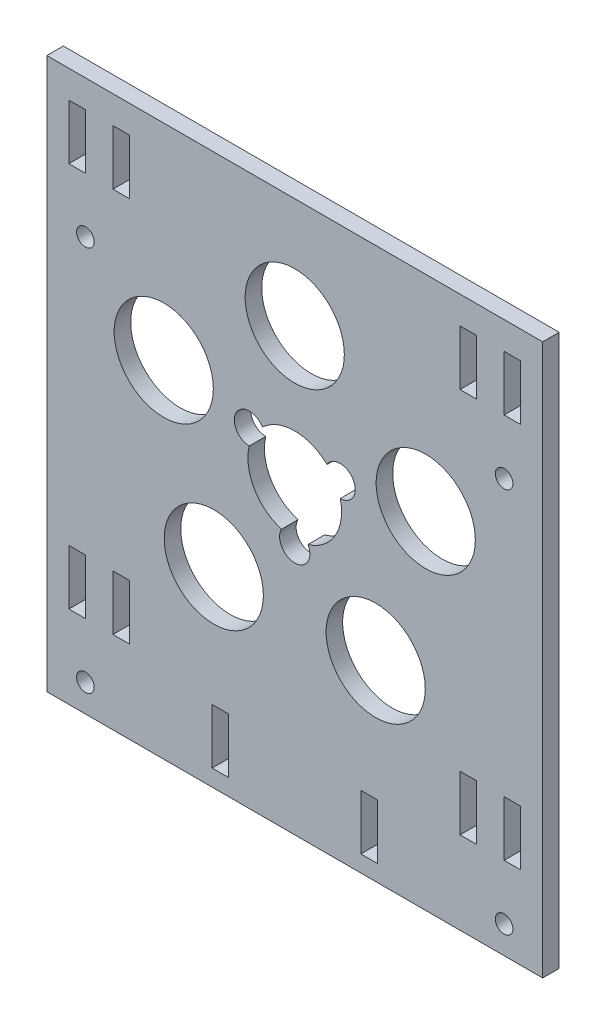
ISO-10303-21;
HEADER;
FILE_DESCRIPTION(('STEP AP214'),'2;1');
FILE_NAME('part.step','',(''),(''),'','','');
FILE_SCHEMA(('AUTOMOTIVE_DESIGN { 1 0 10303 214 1 1 1 1 }'));
ENDSEC;
DATA;
#1=APPLICATION_CONTEXT('core data for automotive mechanical design processes');
#2=APPLICATION_PROTOCOL_DEFINITION('international standard','automotive_design',2000,#1);
#3=PRODUCT_CONTEXT('',#1,'mechanical');
#4=PRODUCT('Part','Part','',(#3));
#5=PRODUCT_RELATED_PRODUCT_CATEGORY('part','',(#4));
#6=PRODUCT_DEFINITION_FORMATION('','',#4);
#7=PRODUCT_DEFINITION_CONTEXT('part definition',#1,'design');
#8=PRODUCT_DEFINITION('design','',#6,#7);
#9=PRODUCT_DEFINITION_SHAPE('','',#8);
#10=(LENGTH_UNIT() NAMED_UNIT(*) SI_UNIT(.MILLI.,.METRE.));
#11=(NAMED_UNIT(*) PLANE_ANGLE_UNIT() SI_UNIT($,.RADIAN.));
#12=(NAMED_UNIT(*) SI_UNIT($,.STERADIAN.) SOLID_ANGLE_UNIT());
#13=UNCERTAINTY_MEASURE_WITH_UNIT(LENGTH_MEASURE(1.E-05),#10,'distance_accuracy_value','');
#14=(GEOMETRIC_REPRESENTATION_CONTEXT(3) GLOBAL_UNCERTAINTY_ASSIGNED_CONTEXT((#13)) GLOBAL_UNIT_ASSIGNED_CONTEXT((#10,
#11,#12)) REPRESENTATION_CONTEXT('',''));
#15=CARTESIAN_POINT('',(0.,0.,0.));
#16=DIRECTION('',(0.,0.,1.));
#17=DIRECTION('',(1.,0.,0.));
#18=AXIS2_PLACEMENT_3D('',#15,#16,#17);
#19=CARTESIAN_POINT('',(44.9999999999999,1.2490009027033E-13,3.));
#20=DIRECTION('',(1.,0.,0.));
#21=DIRECTION('',(0.,1.,0.));
#22=AXIS2_PLACEMENT_3D('',#19,#20,#21);
#23=PLANE('',#22);
#24=DIRECTION('',(0.,-1.,0.));
#25=VECTOR('',#24,1.);
#26=CARTESIAN_POINT('',(44.9999999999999,1.2490009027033E-13,0.));
#27=LINE('',#26,#25);
#28=CARTESIAN_POINT('',(45.,45.,0.));
#29=VERTEX_POINT('',#28);
#30=CARTESIAN_POINT('',(45.,-55.,0.));
#31=VERTEX_POINT('',#30);
#32=EDGE_CURVE('E605',#29,#31,#27,.T.);
#33=ORIENTED_EDGE('',*,*,#32,.F.);
#34=DIRECTION('',(0.,0.,-1.));
#35=VECTOR('',#34,1.);
#36=CARTESIAN_POINT('',(45.,45.,3.));
#37=LINE('',#36,#35);
#38=CARTESIAN_POINT('',(45.,45.,3.));
#39=VERTEX_POINT('',#38);
#40=EDGE_CURVE('E640',#39,#29,#37,.T.);
#41=ORIENTED_EDGE('',*,*,#40,.F.);
#42=DIRECTION('',(0.,-1.,0.));
#43=VECTOR('',#42,1.);
#44=CARTESIAN_POINT('',(44.9999999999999,1.2490009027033E-13,3.));
#45=LINE('',#44,#43);
#46=CARTESIAN_POINT('',(45.,-55.,3.));
#47=VERTEX_POINT('',#46);
#48=EDGE_CURVE('E612',#39,#47,#45,.T.);
#49=ORIENTED_EDGE('',*,*,#48,.T.);
#50=DIRECTION('',(0.,0.,-1.));
#51=VECTOR('',#50,1.);
#52=CARTESIAN_POINT('',(45.,-55.,3.));
#53=LINE('',#52,#51);
#54=EDGE_CURVE('E624',#47,#31,#53,.T.);
#55=ORIENTED_EDGE('',*,*,#54,.T.);
#56=EDGE_LOOP('',(#33,#41,#49,#55));
#57=FACE_BOUND('',#56,.T.);
#58=ADVANCED_FACE('F34',(#57),#23,.T.);
#59=CARTESIAN_POINT('',(0.,45.,3.));
#60=DIRECTION('',(0.,1.,0.));
#61=DIRECTION('',(0.,0.,1.));
#62=AXIS2_PLACEMENT_3D('',#59,#60,#61);
#63=PLANE('',#62);
#64=DIRECTION('',(1.,0.,0.));
#65=VECTOR('',#64,1.);
#66=CARTESIAN_POINT('',(0.,45.,0.));
#67=LINE('',#66,#65);
#68=CARTESIAN_POINT('',(-45.,45.,0.));
#69=VERTEX_POINT('',#68);
#70=EDGE_CURVE('E627',#69,#29,#67,.T.);
#71=ORIENTED_EDGE('',*,*,#70,.F.);
#72=DIRECTION('',(0.,0.,-1.));
#73=VECTOR('',#72,1.);
#74=CARTESIAN_POINT('',(-45.,45.,3.));
#75=LINE('',#74,#73);
#76=CARTESIAN_POINT('',(-45.,45.,3.));
#77=VERTEX_POINT('',#76);
#78=EDGE_CURVE('E638',#77,#69,#75,.T.);
#79=ORIENTED_EDGE('',*,*,#78,.F.);
#80=DIRECTION('',(1.,0.,0.));
#81=VECTOR('',#80,1.);
#82=CARTESIAN_POINT('',(0.,45.,3.));
#83=LINE('',#82,#81);
#84=EDGE_CURVE('E615',#77,#39,#83,.T.);
#85=ORIENTED_EDGE('',*,*,#84,.T.);
#86=ORIENTED_EDGE('',*,*,#40,.T.);
#87=EDGE_LOOP('',(#71,#79,#85,#86));
#88=FACE_BOUND('',#87,.T.);
#89=ADVANCED_FACE('F814',(#88),#63,.T.);
#90=CARTESIAN_POINT('',(-45.,0.,3.));
#91=DIRECTION('',(-1.,0.,0.));
#92=DIRECTION('',(0.,-1.,0.));
#93=AXIS2_PLACEMENT_3D('',#90,#91,#92);
#94=PLANE('',#93);
#95=DIRECTION('',(0.,1.,0.));
#96=VECTOR('',#95,1.);
#97=CARTESIAN_POINT('',(-45.,0.,0.));
#98=LINE('',#97,#96);
#99=CARTESIAN_POINT('',(-45.,-55.,0.));
#100=VERTEX_POINT('',#99);
#101=EDGE_CURVE('E630',#100,#69,#98,.T.);
#102=ORIENTED_EDGE('',*,*,#101,.F.);
#103=DIRECTION('',(0.,0.,-1.));
#104=VECTOR('',#103,1.);
#105=CARTESIAN_POINT('',(-45.,-55.,3.));
#106=LINE('',#105,#104);
#107=CARTESIAN_POINT('',(-45.,-55.,3.));
#108=VERTEX_POINT('',#107);
#109=EDGE_CURVE('E636',#108,#100,#106,.T.);
#110=ORIENTED_EDGE('',*,*,#109,.F.);
#111=DIRECTION('',(0.,1.,0.));
#112=VECTOR('',#111,1.);
#113=CARTESIAN_POINT('',(-45.,0.,3.));
#114=LINE('',#113,#112);
#115=EDGE_CURVE('E619',#108,#77,#114,.T.);
#116=ORIENTED_EDGE('',*,*,#115,.T.);
#117=ORIENTED_EDGE('',*,*,#78,.T.);
#118=EDGE_LOOP('',(#102,#110,#116,#117));
#119=FACE_BOUND('',#118,.T.);
#120=ADVANCED_FACE('F819',(#119),#94,.T.);
#121=CARTESIAN_POINT('',(0.,-55.,3.));
#122=DIRECTION('',(0.,1.,0.));
#123=DIRECTION('',(0.,0.,1.));
#124=AXIS2_PLACEMENT_3D('',#121,#122,#123);
#125=PLANE('',#124);
#126=DIRECTION('',(1.,0.,0.));
#127=VECTOR('',#126,1.);
#128=CARTESIAN_POINT('',(0.,-55.,0.));
#129=LINE('',#128,#127);
#130=EDGE_CURVE('E616',#100,#31,#129,.T.);
#131=ORIENTED_EDGE('',*,*,#130,.T.);
#132=ORIENTED_EDGE('',*,*,#54,.F.);
#133=DIRECTION('',(1.,0.,0.));
#134=VECTOR('',#133,1.);
#135=CARTESIAN_POINT('',(0.,-55.,3.));
#136=LINE('',#135,#134);
#137=EDGE_CURVE('E622',#108,#47,#136,.T.);
#138=ORIENTED_EDGE('',*,*,#137,.F.);
#139=ORIENTED_EDGE('',*,*,#109,.T.);
#140=EDGE_LOOP('',(#131,#132,#138,#139));
#141=FACE_BOUND('',#140,.T.);
#142=ADVANCED_FACE('F834',(#141),#125,.F.);
#143=CARTESIAN_POINT('',(0.,0.,3.));
#144=DIRECTION('',(0.,0.,1.));
#145=DIRECTION('',(1.,0.,0.));
#146=AXIS2_PLACEMENT_3D('',#143,#144,#145);
#147=PLANE('',#146);
#148=CARTESIAN_POINT('',(-38.,-50.,3.));
#149=DIRECTION('',(0.,0.,1.));
#150=DIRECTION('',(1.,0.,0.));
#151=AXIS2_PLACEMENT_3D('',#148,#149,#150);
#152=CIRCLE('',#151,1.6);
#153=CARTESIAN_POINT('',(-36.4,-50.,3.));
#154=VERTEX_POINT('',#153);
#155=EDGE_CURVE('E382',#154,#154,#152,.T.);
#156=ORIENTED_EDGE('',*,*,#155,.F.);
#157=EDGE_LOOP('',(#156));
#158=FACE_BOUND('',#157,.T.);
#159=DIRECTION('',(0.,-1.,0.));
#160=VECTOR('',#159,1.);
#161=CARTESIAN_POINT('',(12.,-42.,3.));
#162=LINE('',#161,#160);
#163=CARTESIAN_POINT('',(12.,-42.,3.));
#164=VERTEX_POINT('',#163);
#165=CARTESIAN_POINT('',(12.,-52.,3.));
#166=VERTEX_POINT('',#165);
#167=EDGE_CURVE('E49',#164,#166,#162,.T.);
#168=ORIENTED_EDGE('',*,*,#167,.F.);
#169=DIRECTION('',(-1.,0.,0.));
#170=VECTOR('',#169,1.);
#171=CARTESIAN_POINT('',(15.,-42.,3.));
#172=LINE('',#171,#170);
#173=CARTESIAN_POINT('',(15.,-42.,3.));
#174=VERTEX_POINT('',#173);
#175=EDGE_CURVE('E375',#174,#164,#172,.T.);
#176=ORIENTED_EDGE('',*,*,#175,.F.);
#177=DIRECTION('',(0.,1.,0.));
#178=VECTOR('',#177,1.);
#179=CARTESIAN_POINT('',(15.,-52.,3.));
#180=LINE('',#179,#178);
#181=CARTESIAN_POINT('',(15.,-52.,3.));
#182=VERTEX_POINT('',#181);
#183=EDGE_CURVE('E358',#182,#174,#180,.T.);
#184=ORIENTED_EDGE('',*,*,#183,.F.);
#185=DIRECTION('',(1.,0.,0.));
#186=VECTOR('',#185,1.);
#187=CARTESIAN_POINT('',(12.,-52.,3.));
#188=LINE('',#187,#186);
#189=EDGE_CURVE('E368',#166,#182,#188,.T.);
#190=ORIENTED_EDGE('',*,*,#189,.F.);
#191=EDGE_LOOP('',(#168,#176,#184,#190));
#192=FACE_BOUND('',#191,.T.);
#193=CARTESIAN_POINT('',(38.,-50.,3.));
#194=DIRECTION('',(0.,0.,1.));
#195=DIRECTION('',(-1.,0.,0.));
#196=AXIS2_PLACEMENT_3D('',#193,#194,#195);
#197=CIRCLE('',#196,1.6);
#198=CARTESIAN_POINT('',(36.4,-50.,3.));
#199=VERTEX_POINT('',#198);
#200=EDGE_CURVE('E1526',#199,#199,#197,.T.);
#201=ORIENTED_EDGE('',*,*,#200,.F.);
#202=EDGE_LOOP('',(#201));
#203=FACE_BOUND('',#202,.T.);
#204=CARTESIAN_POINT('',(-38.,20.,3.));
#205=DIRECTION('',(0.,0.,1.));
#206=DIRECTION('',(1.,0.,0.));
#207=AXIS2_PLACEMENT_3D('',#204,#205,#206);
#208=CIRCLE('',#207,1.6);
#209=CARTESIAN_POINT('',(-36.4,20.,3.));
#210=VERTEX_POINT('',#209);
#211=EDGE_CURVE('E1524',#210,#210,#208,.T.);
#212=ORIENTED_EDGE('',*,*,#211,.F.);
#213=EDGE_LOOP('',(#212));
#214=FACE_BOUND('',#213,.T.);
#215=DIRECTION('',(-1.,0.,0.));
#216=VECTOR('',#215,1.);
#217=CARTESIAN_POINT('',(-41.,40.,3.));
#218=LINE('',#217,#216);
#219=CARTESIAN_POINT('',(-38.,40.,3.));
#220=VERTEX_POINT('',#219);
#221=CARTESIAN_POINT('',(-41.,40.,3.));
#222=VERTEX_POINT('',#221);
#223=EDGE_CURVE('E57',#220,#222,#218,.T.);
#224=ORIENTED_EDGE('',*,*,#223,.F.);
#225=DIRECTION('',(0.,1.,0.));
#226=VECTOR('',#225,1.);
#227=CARTESIAN_POINT('',(-38.,40.,3.));
#228=LINE('',#227,#226);
#229=CARTESIAN_POINT('',(-38.,30.,3.));
#230=VERTEX_POINT('',#229);
#231=EDGE_CURVE('E454',#230,#220,#228,.T.);
#232=ORIENTED_EDGE('',*,*,#231,.F.);
#233=DIRECTION('',(1.,0.,0.));
#234=VECTOR('',#233,1.);
#235=CARTESIAN_POINT('',(-38.,30.,3.));
#236=LINE('',#235,#234);
#237=CARTESIAN_POINT('',(-41.,30.,3.));
#238=VERTEX_POINT('',#237);
#239=EDGE_CURVE('E451',#238,#230,#236,.T.);
#240=ORIENTED_EDGE('',*,*,#239,.F.);
#241=DIRECTION('',(0.,-1.,0.));
#242=VECTOR('',#241,1.);
#243=CARTESIAN_POINT('',(-41.,30.,3.));
#244=LINE('',#243,#242);
#245=EDGE_CURVE('E448',#222,#238,#244,.T.);
#246=ORIENTED_EDGE('',*,*,#245,.F.);
#247=EDGE_LOOP('',(#224,#232,#240,#246));
#248=FACE_BOUND('',#247,.T.);
#249=DIRECTION('',(-1.,0.,0.));
#250=VECTOR('',#249,1.);
#251=CARTESIAN_POINT('',(41.,40.,3.));
#252=LINE('',#251,#250);
#253=CARTESIAN_POINT('',(41.,40.,3.));
#254=VERTEX_POINT('',#253);
#255=CARTESIAN_POINT('',(38.,40.,3.));
#256=VERTEX_POINT('',#255);
#257=EDGE_CURVE('E427',#254,#256,#252,.T.);
#258=ORIENTED_EDGE('',*,*,#257,.F.);
#259=DIRECTION('',(0.,1.,0.));
#260=VECTOR('',#259,1.);
#261=CARTESIAN_POINT('',(41.,30.,3.));
#262=LINE('',#261,#260);
#263=CARTESIAN_POINT('',(41.,30.,3.));
#264=VERTEX_POINT('',#263);
#265=EDGE_CURVE('E436',#264,#254,#262,.T.);
#266=ORIENTED_EDGE('',*,*,#265,.F.);
#267=DIRECTION('',(1.,0.,0.));
#268=VECTOR('',#267,1.);
#269=CARTESIAN_POINT('',(38.,30.,3.));
#270=LINE('',#269,#268);
#271=CARTESIAN_POINT('',(38.,30.,3.));
#272=VERTEX_POINT('',#271);
#273=EDGE_CURVE('E433',#272,#264,#270,.T.);
#274=ORIENTED_EDGE('',*,*,#273,.F.);
#275=DIRECTION('',(0.,-1.,0.));
#276=VECTOR('',#275,1.);
#277=CARTESIAN_POINT('',(38.,40.,3.));
#278=LINE('',#277,#276);
#279=EDGE_CURVE('E429',#256,#272,#278,.T.);
#280=ORIENTED_EDGE('',*,*,#279,.F.);
#281=EDGE_LOOP('',(#258,#266,#274,#280));
#282=FACE_BOUND('',#281,.T.);
#283=DIRECTION('',(-1.,0.,0.));
#284=VECTOR('',#283,1.);
#285=CARTESIAN_POINT('',(41.,-30.,3.));
#286=LINE('',#285,#284);
#287=CARTESIAN_POINT('',(41.,-30.,3.));
#288=VERTEX_POINT('',#287);
#289=CARTESIAN_POINT('',(38.,-30.,3.));
#290=VERTEX_POINT('',#289);
#291=EDGE_CURVE('E407',#288,#290,#286,.T.);
#292=ORIENTED_EDGE('',*,*,#291,.F.);
#293=DIRECTION('',(0.,1.,0.));
#294=VECTOR('',#293,1.);
#295=CARTESIAN_POINT('',(41.,-40.,3.));
#296=LINE('',#295,#294);
#297=CARTESIAN_POINT('',(41.,-40.,3.));
#298=VERTEX_POINT('',#297);
#299=EDGE_CURVE('E416',#298,#288,#296,.T.);
#300=ORIENTED_EDGE('',*,*,#299,.F.);
#301=DIRECTION('',(1.,0.,0.));
#302=VECTOR('',#301,1.);
#303=CARTESIAN_POINT('',(38.,-40.,3.));
#304=LINE('',#303,#302);
#305=CARTESIAN_POINT('',(38.,-40.,3.));
#306=VERTEX_POINT('',#305);
#307=EDGE_CURVE('E413',#306,#298,#304,.T.);
#308=ORIENTED_EDGE('',*,*,#307,.F.);
#309=DIRECTION('',(0.,-1.,0.));
#310=VECTOR('',#309,1.);
#311=CARTESIAN_POINT('',(38.,-30.,3.));
#312=LINE('',#311,#310);
#313=EDGE_CURVE('E409',#290,#306,#312,.T.);
#314=ORIENTED_EDGE('',*,*,#313,.F.);
#315=EDGE_LOOP('',(#292,#300,#308,#314));
#316=FACE_BOUND('',#315,.T.);
#317=DIRECTION('',(-1.,0.,0.));
#318=VECTOR('',#317,1.);
#319=CARTESIAN_POINT('',(-41.,-30.,3.));
#320=LINE('',#319,#318);
#321=CARTESIAN_POINT('',(-38.,-30.,3.));
#322=VERTEX_POINT('',#321);
#323=CARTESIAN_POINT('',(-41.,-30.,3.));
#324=VERTEX_POINT('',#323);
#325=EDGE_CURVE('E385',#322,#324,#320,.T.);
#326=ORIENTED_EDGE('',*,*,#325,.F.);
#327=DIRECTION('',(0.,1.,0.));
#328=VECTOR('',#327,1.);
#329=CARTESIAN_POINT('',(-38.,-30.,3.));
#330=LINE('',#329,#328);
#331=CARTESIAN_POINT('',(-38.,-40.,3.));
#332=VERTEX_POINT('',#331);
#333=EDGE_CURVE('E394',#332,#322,#330,.T.);
#334=ORIENTED_EDGE('',*,*,#333,.F.);
#335=DIRECTION('',(1.,0.,0.));
#336=VECTOR('',#335,1.);
#337=CARTESIAN_POINT('',(-38.,-40.,3.));
#338=LINE('',#337,#336);
#339=CARTESIAN_POINT('',(-41.,-40.,3.));
#340=VERTEX_POINT('',#339);
#341=EDGE_CURVE('E391',#340,#332,#338,.T.);
#342=ORIENTED_EDGE('',*,*,#341,.F.);
#343=DIRECTION('',(0.,-1.,0.));
#344=VECTOR('',#343,1.);
#345=CARTESIAN_POINT('',(-41.,-40.,3.));
#346=LINE('',#345,#344);
#347=EDGE_CURVE('E387',#324,#340,#346,.T.);
#348=ORIENTED_EDGE('',*,*,#347,.F.);
#349=EDGE_LOOP('',(#326,#334,#342,#348));
#350=FACE_BOUND('',#349,.T.);
#351=CARTESIAN_POINT('',(38.,20.,3.));
#352=DIRECTION('',(0.,0.,1.));
#353=DIRECTION('',(-1.,0.,0.));
#354=AXIS2_PLACEMENT_3D('',#351,#352,#353);
#355=CIRCLE('',#354,1.6);
#356=CARTESIAN_POINT('',(36.4,20.,3.));
#357=VERTEX_POINT('',#356);
#358=EDGE_CURVE('E1530',#357,#357,#355,.T.);
#359=ORIENTED_EDGE('',*,*,#358,.F.);
#360=EDGE_LOOP('',(#359));
#361=FACE_BOUND('',#360,.T.);
#362=DIRECTION('',(0.,-1.,0.));
#363=VECTOR('',#362,1.);
#364=CARTESIAN_POINT('',(-15.,-52.,3.));
#365=LINE('',#364,#363);
#366=CARTESIAN_POINT('',(-15.,-42.,3.));
#367=VERTEX_POINT('',#366);
#368=CARTESIAN_POINT('',(-15.,-52.,3.));
#369=VERTEX_POINT('',#368);
#370=EDGE_CURVE('E400',#367,#369,#365,.T.);
#371=ORIENTED_EDGE('',*,*,#370,.F.);
#372=DIRECTION('',(-1.,0.,0.));
#373=VECTOR('',#372,1.);
#374=CARTESIAN_POINT('',(-15.,-42.,3.));
#375=LINE('',#374,#373);
#376=CARTESIAN_POINT('',(-12.,-42.,3.));
#377=VERTEX_POINT('',#376);
#378=EDGE_CURVE('E471',#377,#367,#375,.T.);
#379=ORIENTED_EDGE('',*,*,#378,.F.);
#380=DIRECTION('',(0.,1.,0.));
#381=VECTOR('',#380,1.);
#382=CARTESIAN_POINT('',(-12.,-42.,3.));
#383=LINE('',#382,#381);
#384=CARTESIAN_POINT('',(-12.,-52.,3.));
#385=VERTEX_POINT('',#384);
#386=EDGE_CURVE('E468',#385,#377,#383,.T.);
#387=ORIENTED_EDGE('',*,*,#386,.F.);
#388=DIRECTION('',(1.,0.,0.));
#389=VECTOR('',#388,1.);
#390=CARTESIAN_POINT('',(-12.,-52.,3.));
#391=LINE('',#390,#389);
#392=EDGE_CURVE('E465',#369,#385,#391,.T.);
#393=ORIENTED_EDGE('',*,*,#392,.F.);
#394=EDGE_LOOP('',(#371,#379,#387,#393));
#395=FACE_BOUND('',#394,.T.);
#396=CARTESIAN_POINT('',(0.,0.,3.));
#397=DIRECTION('',(0.,0.,1.));
#398=DIRECTION('',(1.,0.,0.));
#399=AXIS2_PLACEMENT_3D('',#396,#397,#398);
#400=CIRCLE('',#399,8.5);
#401=CARTESIAN_POINT('',(2.39841885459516,-8.1546052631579,3.));
#402=VERTEX_POINT('',#401);
#403=CARTESIAN_POINT('',(8.26130474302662,2.00021097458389,3.));
#404=VERTEX_POINT('',#403);
#405=EDGE_CURVE('E484',#402,#404,#400,.T.);
#406=ORIENTED_EDGE('',*,*,#405,.F.);
#407=CARTESIAN_POINT('',(0.,-9.5,3.));
#408=DIRECTION('',(0.,0.,1.));
#409=DIRECTION('',(1.,0.,0.));
#410=AXIS2_PLACEMENT_3D('',#407,#408,#409);
#411=CIRCLE('',#410,2.75);
#412=CARTESIAN_POINT('',(-2.39841885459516,-8.1546052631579,3.));
#413=VERTEX_POINT('',#412);
#414=EDGE_CURVE('E498',#413,#402,#411,.T.);
#415=ORIENTED_EDGE('',*,*,#414,.F.);
#416=CARTESIAN_POINT('',(0.,0.,3.));
#417=DIRECTION('',(0.,0.,1.));
#418=DIRECTION('',(1.,0.,0.));
#419=AXIS2_PLACEMENT_3D('',#416,#417,#418);
#420=CIRCLE('',#419,8.5);
#421=CARTESIAN_POINT('',(-8.26130474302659,2.000210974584,3.));
#422=VERTEX_POINT('',#421);
#423=EDGE_CURVE('E495',#422,#413,#420,.T.);
#424=ORIENTED_EDGE('',*,*,#423,.F.);
#425=CARTESIAN_POINT('',(-8.22724133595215,4.75000000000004,3.));
#426=DIRECTION('',(0.,0.,1.));
#427=DIRECTION('',(1.,0.,0.));
#428=AXIS2_PLACEMENT_3D('',#425,#426,#427);
#429=CIRCLE('',#428,2.75);
#430=CARTESIAN_POINT('',(-5.86288588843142,6.15439428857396,3.));
#431=VERTEX_POINT('',#430);
#432=EDGE_CURVE('E492',#431,#422,#429,.T.);
#433=ORIENTED_EDGE('',*,*,#432,.F.);
#434=CARTESIAN_POINT('',(0.,0.,3.));
#435=DIRECTION('',(0.,0.,1.));
#436=DIRECTION('',(1.,0.,0.));
#437=AXIS2_PLACEMENT_3D('',#434,#435,#436);
#438=CIRCLE('',#437,8.5);
#439=CARTESIAN_POINT('',(5.8628858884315,6.15439428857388,3.));
#440=VERTEX_POINT('',#439);
#441=EDGE_CURVE('E489',#440,#431,#438,.T.);
#442=ORIENTED_EDGE('',*,*,#441,.F.);
#443=CARTESIAN_POINT('',(8.22724133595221,4.74999999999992,3.));
#444=DIRECTION('',(0.,0.,1.));
#445=DIRECTION('',(1.,0.,0.));
#446=AXIS2_PLACEMENT_3D('',#443,#444,#445);
#447=CIRCLE('',#446,2.75);
#448=EDGE_CURVE('E486',#404,#440,#447,.T.);
#449=ORIENTED_EDGE('',*,*,#448,.F.);
#450=EDGE_LOOP('',(#406,#415,#424,#433,#442,#449));
#451=FACE_BOUND('',#450,.T.);
#452=CARTESIAN_POINT('',(-23.7764129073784,7.72542485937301,3.));
#453=DIRECTION('',(0.,0.,1.));
#454=DIRECTION('',(1.,0.,0.));
#455=AXIS2_PLACEMENT_3D('',#452,#453,#454);
#456=CIRCLE('',#455,9.);
#457=CARTESIAN_POINT('',(-14.7764129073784,7.72542485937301,3.));
#458=VERTEX_POINT('',#457);
#459=EDGE_CURVE('E504',#458,#458,#456,.T.);
#460=ORIENTED_EDGE('',*,*,#459,.F.);
#461=EDGE_LOOP('',(#460));
#462=FACE_BOUND('',#461,.T.);
#463=CARTESIAN_POINT('',(-1.46100916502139E-12,25.0000000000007,3.));
#464=DIRECTION('',(0.,0.,1.));
#465=DIRECTION('',(1.,0.,0.));
#466=AXIS2_PLACEMENT_3D('',#463,#464,#465);
#467=CIRCLE('',#466,9.00000000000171);
#468=CARTESIAN_POINT('',(9.00000000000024,25.0000000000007,3.));
#469=VERTEX_POINT('',#468);
#470=EDGE_CURVE('E522',#469,#469,#467,.T.);
#471=ORIENTED_EDGE('',*,*,#470,.F.);
#472=EDGE_LOOP('',(#471));
#473=FACE_BOUND('',#472,.T.);
#474=CARTESIAN_POINT('',(-14.6946313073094,-20.2254248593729,3.));
#475=DIRECTION('',(0.,0.,1.));
#476=DIRECTION('',(1.,0.,0.));
#477=AXIS2_PLACEMENT_3D('',#474,#475,#476);
#478=CIRCLE('',#477,8.99999999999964);
#479=CARTESIAN_POINT('',(-5.69463130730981,-20.2254248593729,3.));
#480=VERTEX_POINT('',#479);
#481=EDGE_CURVE('E519',#480,#480,#478,.T.);
#482=ORIENTED_EDGE('',*,*,#481,.F.);
#483=EDGE_LOOP('',(#482));
#484=FACE_BOUND('',#483,.T.);
#485=CARTESIAN_POINT('',(14.6946313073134,-20.2254248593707,3.));
#486=DIRECTION('',(0.,0.,1.));
#487=DIRECTION('',(1.,0.,0.));
#488=AXIS2_PLACEMENT_3D('',#485,#486,#487);
#489=CIRCLE('',#488,9.00000000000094);
#490=CARTESIAN_POINT('',(23.6946313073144,-20.2254248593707,3.));
#491=VERTEX_POINT('',#490);
#492=EDGE_CURVE('E515',#491,#491,#489,.T.);
#493=ORIENTED_EDGE('',*,*,#492,.F.);
#494=EDGE_LOOP('',(#493));
#495=FACE_BOUND('',#494,.T.);
#496=CARTESIAN_POINT('',(23.7764129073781,7.72542485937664,3.));
#497=DIRECTION('',(0.,0.,1.));
#498=DIRECTION('',(1.,0.,0.));
#499=AXIS2_PLACEMENT_3D('',#496,#497,#498);
#500=CIRCLE('',#499,9.00000000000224);
#501=CARTESIAN_POINT('',(32.7764129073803,7.72542485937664,3.));
#502=VERTEX_POINT('',#501);
#503=EDGE_CURVE('E518',#502,#502,#500,.T.);
#504=ORIENTED_EDGE('',*,*,#503,.F.);
#505=EDGE_LOOP('',(#504));
#506=FACE_BOUND('',#505,.T.);
#507=DIRECTION('',(-1.,0.,0.));
#508=VECTOR('',#507,1.);
#509=CARTESIAN_POINT('',(33.,40.,3.));
#510=LINE('',#509,#508);
#511=CARTESIAN_POINT('',(33.,40.,3.));
#512=VERTEX_POINT('',#511);
#513=CARTESIAN_POINT('',(30.,40.,3.));
#514=VERTEX_POINT('',#513);
#515=EDGE_CURVE('E552',#512,#514,#510,.T.);
#516=ORIENTED_EDGE('',*,*,#515,.F.);
#517=DIRECTION('',(0.,1.,0.));
#518=VECTOR('',#517,1.);
#519=CARTESIAN_POINT('',(33.,30.,3.));
#520=LINE('',#519,#518);
#521=CARTESIAN_POINT('',(33.,30.,3.));
#522=VERTEX_POINT('',#521);
#523=EDGE_CURVE('E561',#522,#512,#520,.T.);
#524=ORIENTED_EDGE('',*,*,#523,.F.);
#525=DIRECTION('',(1.,0.,0.));
#526=VECTOR('',#525,1.);
#527=CARTESIAN_POINT('',(30.,30.,3.));
#528=LINE('',#527,#526);
#529=CARTESIAN_POINT('',(30.,30.,3.));
#530=VERTEX_POINT('',#529);
#531=EDGE_CURVE('E558',#530,#522,#528,.T.);
#532=ORIENTED_EDGE('',*,*,#531,.F.);
#533=DIRECTION('',(0.,-1.,0.));
#534=VECTOR('',#533,1.);
#535=CARTESIAN_POINT('',(30.,40.,3.));
#536=LINE('',#535,#534);
#537=EDGE_CURVE('E554',#514,#530,#536,.T.);
#538=ORIENTED_EDGE('',*,*,#537,.F.);
#539=EDGE_LOOP('',(#516,#524,#532,#538));
#540=FACE_BOUND('',#539,.T.);
#541=DIRECTION('',(-1.,0.,0.));
#542=VECTOR('',#541,1.);
#543=CARTESIAN_POINT('',(-30.,-30.,3.));
#544=LINE('',#543,#542);
#545=CARTESIAN_POINT('',(-30.,-30.,3.));
#546=VERTEX_POINT('',#545);
#547=CARTESIAN_POINT('',(-33.,-30.,3.));
#548=VERTEX_POINT('',#547);
#549=EDGE_CURVE('E545',#546,#548,#544,.T.);
#550=ORIENTED_EDGE('',*,*,#549,.F.);
#551=DIRECTION('',(0.,1.,0.));
#552=VECTOR('',#551,1.);
#553=CARTESIAN_POINT('',(-30.,-40.,3.));
#554=LINE('',#553,#552);
#555=CARTESIAN_POINT('',(-30.,-40.,3.));
#556=VERTEX_POINT('',#555);
#557=EDGE_CURVE('E581',#556,#546,#554,.T.);
#558=ORIENTED_EDGE('',*,*,#557,.F.);
#559=DIRECTION('',(1.,0.,0.));
#560=VECTOR('',#559,1.);
#561=CARTESIAN_POINT('',(-33.,-40.,3.));
#562=LINE('',#561,#560);
#563=CARTESIAN_POINT('',(-33.,-40.,3.));
#564=VERTEX_POINT('',#563);
#565=EDGE_CURVE('E578',#564,#556,#562,.T.);
#566=ORIENTED_EDGE('',*,*,#565,.F.);
#567=DIRECTION('',(0.,-1.,0.));
#568=VECTOR('',#567,1.);
#569=CARTESIAN_POINT('',(-33.,-30.,3.));
#570=LINE('',#569,#568);
#571=EDGE_CURVE('E575',#548,#564,#570,.T.);
#572=ORIENTED_EDGE('',*,*,#571,.F.);
#573=EDGE_LOOP('',(#550,#558,#566,#572));
#574=FACE_BOUND('',#573,.T.);
#575=DIRECTION('',(-1.,0.,0.));
#576=VECTOR('',#575,1.);
#577=CARTESIAN_POINT('',(33.,-30.,3.));
#578=LINE('',#577,#576);
#579=CARTESIAN_POINT('',(33.,-30.,3.));
#580=VERTEX_POINT('',#579);
#581=CARTESIAN_POINT('',(30.,-30.,3.));
#582=VERTEX_POINT('',#581);
#583=EDGE_CURVE('E530',#580,#582,#578,.T.);
#584=ORIENTED_EDGE('',*,*,#583,.F.);
#585=DIRECTION('',(0.,1.,0.));
#586=VECTOR('',#585,1.);
#587=CARTESIAN_POINT('',(33.,-40.,3.));
#588=LINE('',#587,#586);
#589=CARTESIAN_POINT('',(33.,-40.,3.));
#590=VERTEX_POINT('',#589);
#591=EDGE_CURVE('E539',#590,#580,#588,.T.);
#592=ORIENTED_EDGE('',*,*,#591,.F.);
#593=DIRECTION('',(1.,0.,0.));
#594=VECTOR('',#593,1.);
#595=CARTESIAN_POINT('',(30.,-40.,3.));
#596=LINE('',#595,#594);
#597=CARTESIAN_POINT('',(30.,-40.,3.));
#598=VERTEX_POINT('',#597);
#599=EDGE_CURVE('E536',#598,#590,#596,.T.);
#600=ORIENTED_EDGE('',*,*,#599,.F.);
#601=DIRECTION('',(0.,-1.,0.));
#602=VECTOR('',#601,1.);
#603=CARTESIAN_POINT('',(30.,-30.,3.));
#604=LINE('',#603,#602);
#605=EDGE_CURVE('E532',#582,#598,#604,.T.);
#606=ORIENTED_EDGE('',*,*,#605,.F.);
#607=EDGE_LOOP('',(#584,#592,#600,#606));
#608=FACE_BOUND('',#607,.T.);
#609=DIRECTION('',(-1.,0.,0.));
#610=VECTOR('',#609,1.);
#611=CARTESIAN_POINT('',(-30.,40.,3.));
#612=LINE('',#611,#610);
#613=CARTESIAN_POINT('',(-30.,40.,3.));
#614=VERTEX_POINT('',#613);
#615=CARTESIAN_POINT('',(-33.,40.,3.));
#616=VERTEX_POINT('',#615);
#617=EDGE_CURVE('E567',#614,#616,#612,.T.);
#618=ORIENTED_EDGE('',*,*,#617,.F.);
#619=DIRECTION('',(0.,1.,0.));
#620=VECTOR('',#619,1.);
#621=CARTESIAN_POINT('',(-30.,30.,3.));
#622=LINE('',#621,#620);
#623=CARTESIAN_POINT('',(-30.,30.,3.));
#624=VERTEX_POINT('',#623);
#625=EDGE_CURVE('E599',#624,#614,#622,.T.);
#626=ORIENTED_EDGE('',*,*,#625,.F.);
#627=DIRECTION('',(1.,0.,0.));
#628=VECTOR('',#627,1.);
#629=CARTESIAN_POINT('',(-33.,30.,3.));
#630=LINE('',#629,#628);
#631=CARTESIAN_POINT('',(-33.,30.,3.));
#632=VERTEX_POINT('',#631);
#633=EDGE_CURVE('E596',#632,#624,#630,.T.);
#634=ORIENTED_EDGE('',*,*,#633,.F.);
#635=DIRECTION('',(0.,-1.,0.));
#636=VECTOR('',#635,1.);
#637=CARTESIAN_POINT('',(-33.,40.,3.));
#638=LINE('',#637,#636);
#639=EDGE_CURVE('E593',#616,#632,#638,.T.);
#640=ORIENTED_EDGE('',*,*,#639,.F.);
#641=EDGE_LOOP('',(#618,#626,#634,#640));
#642=FACE_BOUND('',#641,.T.);
#643=ORIENTED_EDGE('',*,*,#48,.F.);
#644=ORIENTED_EDGE('',*,*,#84,.F.);
#645=ORIENTED_EDGE('',*,*,#115,.F.);
#646=ORIENTED_EDGE('',*,*,#137,.T.);
#647=EDGE_LOOP('',(#643,#644,#645,#646));
#648=FACE_BOUND('',#647,.T.);
#649=ADVANCED_FACE('F372',(#158,#192,#203,#214,#248,#282,#316,#350,#361,#395,#451,#462,#473,
#484,#495,#506,#540,#574,#608,#642,#648),#147,.T.);
#650=CARTESIAN_POINT('',(0.,0.,0.));
#651=DIRECTION('',(0.,0.,1.));
#652=DIRECTION('',(1.,0.,0.));
#653=AXIS2_PLACEMENT_3D('',#650,#651,#652);
#654=PLANE('',#653);
#655=CARTESIAN_POINT('',(-38.,-50.,0.));
#656=DIRECTION('',(0.,0.,1.));
#657=DIRECTION('',(1.,0.,0.));
#658=AXIS2_PLACEMENT_3D('',#655,#656,#657);
#659=CIRCLE('',#658,1.6);
#660=CARTESIAN_POINT('',(-36.4,-50.,0.));
#661=VERTEX_POINT('',#660);
#662=EDGE_CURVE('E37',#661,#661,#659,.T.);
#663=ORIENTED_EDGE('',*,*,#662,.T.);
#664=EDGE_LOOP('',(#663));
#665=FACE_BOUND('',#664,.T.);
#666=DIRECTION('',(-1.,0.,0.));
#667=VECTOR('',#666,1.);
#668=CARTESIAN_POINT('',(0.,-42.,0.));
#669=LINE('',#668,#667);
#670=CARTESIAN_POINT('',(15.,-42.,0.));
#671=VERTEX_POINT('',#670);
#672=CARTESIAN_POINT('',(12.,-42.,0.));
#673=VERTEX_POINT('',#672);
#674=EDGE_CURVE('E42',#671,#673,#669,.T.);
#675=ORIENTED_EDGE('',*,*,#674,.T.);
#676=DIRECTION('',(0.,-1.,0.));
#677=VECTOR('',#676,1.);
#678=CARTESIAN_POINT('',(12.,0.,0.));
#679=LINE('',#678,#677);
#680=CARTESIAN_POINT('',(12.,-52.,0.));
#681=VERTEX_POINT('',#680);
#682=EDGE_CURVE('E11',#673,#681,#679,.T.);
#683=ORIENTED_EDGE('',*,*,#682,.T.);
#684=DIRECTION('',(1.,0.,0.));
#685=VECTOR('',#684,1.);
#686=CARTESIAN_POINT('',(0.,-52.,0.));
#687=LINE('',#686,#685);
#688=CARTESIAN_POINT('',(15.,-52.,0.));
#689=VERTEX_POINT('',#688);
#690=EDGE_CURVE('E784',#681,#689,#687,.T.);
#691=ORIENTED_EDGE('',*,*,#690,.T.);
#692=DIRECTION('',(0.,1.,0.));
#693=VECTOR('',#692,1.);
#694=CARTESIAN_POINT('',(15.,0.,0.));
#695=LINE('',#694,#693);
#696=EDGE_CURVE('E361',#689,#671,#695,.T.);
#697=ORIENTED_EDGE('',*,*,#696,.T.);
#698=EDGE_LOOP('',(#675,#683,#691,#697));
#699=FACE_BOUND('',#698,.T.);
#700=CARTESIAN_POINT('',(38.,-50.,0.));
#701=DIRECTION('',(0.,0.,1.));
#702=DIRECTION('',(1.,0.,0.));
#703=AXIS2_PLACEMENT_3D('',#700,#701,#702);
#704=CIRCLE('',#703,1.6);
#705=CARTESIAN_POINT('',(39.6,-50.,0.));
#706=VERTEX_POINT('',#705);
#707=EDGE_CURVE('E787',#706,#706,#704,.T.);
#708=ORIENTED_EDGE('',*,*,#707,.T.);
#709=EDGE_LOOP('',(#708));
#710=FACE_BOUND('',#709,.T.);
#711=CARTESIAN_POINT('',(-38.,20.,0.));
#712=DIRECTION('',(0.,0.,1.));
#713=DIRECTION('',(1.,0.,0.));
#714=AXIS2_PLACEMENT_3D('',#711,#712,#713);
#715=CIRCLE('',#714,1.6);
#716=CARTESIAN_POINT('',(-36.4,20.,0.));
#717=VERTEX_POINT('',#716);
#718=EDGE_CURVE('E736',#717,#717,#715,.T.);
#719=ORIENTED_EDGE('',*,*,#718,.T.);
#720=EDGE_LOOP('',(#719));
#721=FACE_BOUND('',#720,.T.);
#722=DIRECTION('',(0.,1.,0.));
#723=VECTOR('',#722,1.);
#724=CARTESIAN_POINT('',(-38.,0.,0.));
#725=LINE('',#724,#723);
#726=CARTESIAN_POINT('',(-38.,30.,0.));
#727=VERTEX_POINT('',#726);
#728=CARTESIAN_POINT('',(-38.,40.,0.));
#729=VERTEX_POINT('',#728);
#730=EDGE_CURVE('E778',#727,#729,#725,.T.);
#731=ORIENTED_EDGE('',*,*,#730,.T.);
#732=DIRECTION('',(-1.,0.,0.));
#733=VECTOR('',#732,1.);
#734=CARTESIAN_POINT('',(0.,40.0000000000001,0.));
#735=LINE('',#734,#733);
#736=CARTESIAN_POINT('',(-41.,40.,0.));
#737=VERTEX_POINT('',#736);
#738=EDGE_CURVE('E781',#729,#737,#735,.T.);
#739=ORIENTED_EDGE('',*,*,#738,.T.);
#740=DIRECTION('',(0.,-1.,0.));
#741=VECTOR('',#740,1.);
#742=CARTESIAN_POINT('',(-41.,0.,0.));
#743=LINE('',#742,#741);
#744=CARTESIAN_POINT('',(-41.,30.,0.));
#745=VERTEX_POINT('',#744);
#746=EDGE_CURVE('E772',#737,#745,#743,.T.);
#747=ORIENTED_EDGE('',*,*,#746,.T.);
#748=DIRECTION('',(1.,0.,0.));
#749=VECTOR('',#748,1.);
#750=CARTESIAN_POINT('',(0.,30.0000000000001,0.));
#751=LINE('',#750,#749);
#752=EDGE_CURVE('E775',#745,#727,#751,.T.);
#753=ORIENTED_EDGE('',*,*,#752,.T.);
#754=EDGE_LOOP('',(#731,#739,#747,#753));
#755=FACE_BOUND('',#754,.T.);
#756=DIRECTION('',(0.,1.,0.));
#757=VECTOR('',#756,1.);
#758=CARTESIAN_POINT('',(41.,0.,0.));
#759=LINE('',#758,#757);
#760=CARTESIAN_POINT('',(41.,30.,0.));
#761=VERTEX_POINT('',#760);
#762=CARTESIAN_POINT('',(41.,40.,0.));
#763=VERTEX_POINT('',#762);
#764=EDGE_CURVE('E766',#761,#763,#759,.T.);
#765=ORIENTED_EDGE('',*,*,#764,.T.);
#766=DIRECTION('',(-1.,0.,0.));
#767=VECTOR('',#766,1.);
#768=CARTESIAN_POINT('',(0.,40.,0.));
#769=LINE('',#768,#767);
#770=CARTESIAN_POINT('',(38.,40.,0.));
#771=VERTEX_POINT('',#770);
#772=EDGE_CURVE('E769',#763,#771,#769,.T.);
#773=ORIENTED_EDGE('',*,*,#772,.T.);
#774=DIRECTION('',(0.,-1.,0.));
#775=VECTOR('',#774,1.);
#776=CARTESIAN_POINT('',(38.,0.,0.));
#777=LINE('',#776,#775);
#778=CARTESIAN_POINT('',(38.,30.,0.));
#779=VERTEX_POINT('',#778);
#780=EDGE_CURVE('E760',#771,#779,#777,.T.);
#781=ORIENTED_EDGE('',*,*,#780,.T.);
#782=DIRECTION('',(1.,0.,0.));
#783=VECTOR('',#782,1.);
#784=CARTESIAN_POINT('',(0.,30.,0.));
#785=LINE('',#784,#783);
#786=EDGE_CURVE('E763',#779,#761,#785,.T.);
#787=ORIENTED_EDGE('',*,*,#786,.T.);
#788=EDGE_LOOP('',(#765,#773,#781,#787));
#789=FACE_BOUND('',#788,.T.);
#790=DIRECTION('',(0.,1.,0.));
#791=VECTOR('',#790,1.);
#792=CARTESIAN_POINT('',(41.,0.,0.));
#793=LINE('',#792,#791);
#794=CARTESIAN_POINT('',(41.,-40.,0.));
#795=VERTEX_POINT('',#794);
#796=CARTESIAN_POINT('',(41.,-30.,0.));
#797=VERTEX_POINT('',#796);
#798=EDGE_CURVE('E754',#795,#797,#793,.T.);
#799=ORIENTED_EDGE('',*,*,#798,.T.);
#800=DIRECTION('',(-1.,0.,0.));
#801=VECTOR('',#800,1.);
#802=CARTESIAN_POINT('',(0.,-30.,0.));
#803=LINE('',#802,#801);
#804=CARTESIAN_POINT('',(38.,-30.,0.));
#805=VERTEX_POINT('',#804);
#806=EDGE_CURVE('E757',#797,#805,#803,.T.);
#807=ORIENTED_EDGE('',*,*,#806,.T.);
#808=DIRECTION('',(0.,-1.,0.));
#809=VECTOR('',#808,1.);
#810=CARTESIAN_POINT('',(38.,0.,0.));
#811=LINE('',#810,#809);
#812=CARTESIAN_POINT('',(38.,-40.,0.));
#813=VERTEX_POINT('',#812);
#814=EDGE_CURVE('E748',#805,#813,#811,.T.);
#815=ORIENTED_EDGE('',*,*,#814,.T.);
#816=DIRECTION('',(1.,0.,0.));
#817=VECTOR('',#816,1.);
#818=CARTESIAN_POINT('',(0.,-40.,0.));
#819=LINE('',#818,#817);
#820=EDGE_CURVE('E751',#813,#795,#819,.T.);
#821=ORIENTED_EDGE('',*,*,#820,.T.);
#822=EDGE_LOOP('',(#799,#807,#815,#821));
#823=FACE_BOUND('',#822,.T.);
#824=DIRECTION('',(0.,1.,0.));
#825=VECTOR('',#824,1.);
#826=CARTESIAN_POINT('',(-38.,0.,0.));
#827=LINE('',#826,#825);
#828=CARTESIAN_POINT('',(-38.,-40.,0.));
#829=VERTEX_POINT('',#828);
#830=CARTESIAN_POINT('',(-38.,-30.,0.));
#831=VERTEX_POINT('',#830);
#832=EDGE_CURVE('E742',#829,#831,#827,.T.);
#833=ORIENTED_EDGE('',*,*,#832,.T.);
#834=DIRECTION('',(-1.,0.,0.));
#835=VECTOR('',#834,1.);
#836=CARTESIAN_POINT('',(0.,-29.9999999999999,0.));
#837=LINE('',#836,#835);
#838=CARTESIAN_POINT('',(-41.,-30.,0.));
#839=VERTEX_POINT('',#838);
#840=EDGE_CURVE('E745',#831,#839,#837,.T.);
#841=ORIENTED_EDGE('',*,*,#840,.T.);
#842=DIRECTION('',(0.,-1.,0.));
#843=VECTOR('',#842,1.);
#844=CARTESIAN_POINT('',(-41.,0.,0.));
#845=LINE('',#844,#843);
#846=CARTESIAN_POINT('',(-41.,-40.,0.));
#847=VERTEX_POINT('',#846);
#848=EDGE_CURVE('E733',#839,#847,#845,.T.);
#849=ORIENTED_EDGE('',*,*,#848,.T.);
#850=DIRECTION('',(1.,0.,0.));
#851=VECTOR('',#850,1.);
#852=CARTESIAN_POINT('',(0.,-39.9999999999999,0.));
#853=LINE('',#852,#851);
#854=EDGE_CURVE('E739',#847,#829,#853,.T.);
#855=ORIENTED_EDGE('',*,*,#854,.T.);
#856=EDGE_LOOP('',(#833,#841,#849,#855));
#857=FACE_BOUND('',#856,.T.);
#858=CARTESIAN_POINT('',(38.,20.,0.));
#859=DIRECTION('',(0.,0.,1.));
#860=DIRECTION('',(1.,0.,0.));
#861=AXIS2_PLACEMENT_3D('',#858,#859,#860);
#862=CIRCLE('',#861,1.6);
#863=CARTESIAN_POINT('',(39.6,20.,0.));
#864=VERTEX_POINT('',#863);
#865=EDGE_CURVE('E477',#864,#864,#862,.T.);
#866=ORIENTED_EDGE('',*,*,#865,.T.);
#867=EDGE_LOOP('',(#866));
#868=FACE_BOUND('',#867,.T.);
#869=DIRECTION('',(-1.,0.,0.));
#870=VECTOR('',#869,1.);
#871=CARTESIAN_POINT('',(0.,-42.,0.));
#872=LINE('',#871,#870);
#873=CARTESIAN_POINT('',(-12.,-42.,0.));
#874=VERTEX_POINT('',#873);
#875=CARTESIAN_POINT('',(-15.,-42.,0.));
#876=VERTEX_POINT('',#875);
#877=EDGE_CURVE('E727',#874,#876,#872,.T.);
#878=ORIENTED_EDGE('',*,*,#877,.T.);
#879=DIRECTION('',(0.,-1.,0.));
#880=VECTOR('',#879,1.);
#881=CARTESIAN_POINT('',(-15.,0.,0.));
#882=LINE('',#881,#880);
#883=CARTESIAN_POINT('',(-15.,-52.,0.));
#884=VERTEX_POINT('',#883);
#885=EDGE_CURVE('E730',#876,#884,#882,.T.);
#886=ORIENTED_EDGE('',*,*,#885,.T.);
#887=DIRECTION('',(1.,0.,0.));
#888=VECTOR('',#887,1.);
#889=CARTESIAN_POINT('',(0.,-52.,0.));
#890=LINE('',#889,#888);
#891=CARTESIAN_POINT('',(-12.,-52.,0.));
#892=VERTEX_POINT('',#891);
#893=EDGE_CURVE('E721',#884,#892,#890,.T.);
#894=ORIENTED_EDGE('',*,*,#893,.T.);
#895=DIRECTION('',(0.,1.,0.));
#896=VECTOR('',#895,1.);
#897=CARTESIAN_POINT('',(-12.,0.,0.));
#898=LINE('',#897,#896);
#899=EDGE_CURVE('E724',#892,#874,#898,.T.);
#900=ORIENTED_EDGE('',*,*,#899,.T.);
#901=EDGE_LOOP('',(#878,#886,#894,#900));
#902=FACE_BOUND('',#901,.T.);
#903=CARTESIAN_POINT('',(0.,-9.5,0.));
#904=DIRECTION('',(0.,0.,1.));
#905=DIRECTION('',(1.,0.,0.));
#906=AXIS2_PLACEMENT_3D('',#903,#904,#905);
#907=CIRCLE('',#906,2.75);
#908=CARTESIAN_POINT('',(-2.39841885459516,-8.1546052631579,0.));
#909=VERTEX_POINT('',#908);
#910=CARTESIAN_POINT('',(2.39841885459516,-8.1546052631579,0.));
#911=VERTEX_POINT('',#910);
#912=EDGE_CURVE('E715',#909,#911,#907,.T.);
#913=ORIENTED_EDGE('',*,*,#912,.T.);
#914=CARTESIAN_POINT('',(0.,0.,0.));
#915=DIRECTION('',(0.,0.,1.));
#916=DIRECTION('',(1.,0.,0.));
#917=AXIS2_PLACEMENT_3D('',#914,#915,#916);
#918=CIRCLE('',#917,8.5);
#919=CARTESIAN_POINT('',(8.26130474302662,2.00021097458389,0.));
#920=VERTEX_POINT('',#919);
#921=EDGE_CURVE('E718',#911,#920,#918,.T.);
#922=ORIENTED_EDGE('',*,*,#921,.T.);
#923=CARTESIAN_POINT('',(8.22724133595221,4.74999999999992,0.));
#924=DIRECTION('',(0.,0.,1.));
#925=DIRECTION('',(1.,0.,0.));
#926=AXIS2_PLACEMENT_3D('',#923,#924,#925);
#927=CIRCLE('',#926,2.75);
#928=CARTESIAN_POINT('',(5.8628858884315,6.15439428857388,0.));
#929=VERTEX_POINT('',#928);
#930=EDGE_CURVE('E690',#920,#929,#927,.T.);
#931=ORIENTED_EDGE('',*,*,#930,.T.);
#932=CARTESIAN_POINT('',(0.,0.,0.));
#933=DIRECTION('',(0.,0.,1.));
#934=DIRECTION('',(1.,0.,0.));
#935=AXIS2_PLACEMENT_3D('',#932,#933,#934);
#936=CIRCLE('',#935,8.5);
#937=CARTESIAN_POINT('',(-5.86288588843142,6.15439428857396,0.));
#938=VERTEX_POINT('',#937);
#939=EDGE_CURVE('E706',#929,#938,#936,.T.);
#940=ORIENTED_EDGE('',*,*,#939,.T.);
#941=CARTESIAN_POINT('',(-8.22724133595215,4.75000000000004,0.));
#942=DIRECTION('',(0.,0.,1.));
#943=DIRECTION('',(1.,0.,0.));
#944=AXIS2_PLACEMENT_3D('',#941,#942,#943);
#945=CIRCLE('',#944,2.75);
#946=CARTESIAN_POINT('',(-8.26130474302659,2.000210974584,0.));
#947=VERTEX_POINT('',#946);
#948=EDGE_CURVE('E709',#938,#947,#945,.T.);
#949=ORIENTED_EDGE('',*,*,#948,.T.);
#950=CARTESIAN_POINT('',(0.,0.,0.));
#951=DIRECTION('',(0.,0.,1.));
#952=DIRECTION('',(1.,0.,0.));
#953=AXIS2_PLACEMENT_3D('',#950,#951,#952);
#954=CIRCLE('',#953,8.5);
#955=EDGE_CURVE('E712',#947,#909,#954,.T.);
#956=ORIENTED_EDGE('',*,*,#955,.T.);
#957=EDGE_LOOP('',(#913,#922,#931,#940,#949,#956));
#958=FACE_BOUND('',#957,.T.);
#959=CARTESIAN_POINT('',(-23.7764129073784,7.72542485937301,0.));
#960=DIRECTION('',(0.,0.,1.));
#961=DIRECTION('',(1.,0.,0.));
#962=AXIS2_PLACEMENT_3D('',#959,#960,#961);
#963=CIRCLE('',#962,9.);
#964=CARTESIAN_POINT('',(-14.7764129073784,7.72542485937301,0.));
#965=VERTEX_POINT('',#964);
#966=EDGE_CURVE('E533',#965,#965,#963,.T.);
#967=ORIENTED_EDGE('',*,*,#966,.T.);
#968=EDGE_LOOP('',(#967));
#969=FACE_BOUND('',#968,.T.);
#970=CARTESIAN_POINT('',(-1.46100916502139E-12,25.0000000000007,0.));
#971=DIRECTION('',(0.,0.,1.));
#972=DIRECTION('',(1.,0.,0.));
#973=AXIS2_PLACEMENT_3D('',#970,#971,#972);
#974=CIRCLE('',#973,9.00000000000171);
#975=CARTESIAN_POINT('',(9.00000000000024,25.0000000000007,0.));
#976=VERTEX_POINT('',#975);
#977=EDGE_CURVE('E699',#976,#976,#974,.T.);
#978=ORIENTED_EDGE('',*,*,#977,.T.);
#979=EDGE_LOOP('',(#978));
#980=FACE_BOUND('',#979,.T.);
#981=CARTESIAN_POINT('',(-14.6946313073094,-20.2254248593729,0.));
#982=DIRECTION('',(0.,0.,1.));
#983=DIRECTION('',(1.,0.,0.));
#984=AXIS2_PLACEMENT_3D('',#981,#982,#983);
#985=CIRCLE('',#984,8.99999999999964);
#986=CARTESIAN_POINT('',(-5.69463130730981,-20.2254248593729,0.));
#987=VERTEX_POINT('',#986);
#988=EDGE_CURVE('E696',#987,#987,#985,.T.);
#989=ORIENTED_EDGE('',*,*,#988,.T.);
#990=EDGE_LOOP('',(#989));
#991=FACE_BOUND('',#990,.T.);
#992=CARTESIAN_POINT('',(14.6946313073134,-20.2254248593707,0.));
#993=DIRECTION('',(0.,0.,1.));
#994=DIRECTION('',(1.,0.,0.));
#995=AXIS2_PLACEMENT_3D('',#992,#993,#994);
#996=CIRCLE('',#995,9.00000000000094);
#997=CARTESIAN_POINT('',(23.6946313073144,-20.2254248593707,0.));
#998=VERTEX_POINT('',#997);
#999=EDGE_CURVE('E693',#998,#998,#996,.T.);
#1000=ORIENTED_EDGE('',*,*,#999,.T.);
#1001=EDGE_LOOP('',(#1000));
#1002=FACE_BOUND('',#1001,.T.);
#1003=CARTESIAN_POINT('',(23.7764129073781,7.72542485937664,0.));
#1004=DIRECTION('',(0.,0.,1.));
#1005=DIRECTION('',(1.,0.,0.));
#1006=AXIS2_PLACEMENT_3D('',#1003,#1004,#1005);
#1007=CIRCLE('',#1006,9.00000000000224);
#1008=CARTESIAN_POINT('',(32.7764129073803,7.72542485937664,0.));
#1009=VERTEX_POINT('',#1008);
#1010=EDGE_CURVE('E529',#1009,#1009,#1007,.T.);
#1011=ORIENTED_EDGE('',*,*,#1010,.T.);
#1012=EDGE_LOOP('',(#1011));
#1013=FACE_BOUND('',#1012,.T.);
#1014=DIRECTION('',(0.,1.,0.));
#1015=VECTOR('',#1014,1.);
#1016=CARTESIAN_POINT('',(33.,0.,0.));
#1017=LINE('',#1016,#1015);
#1018=CARTESIAN_POINT('',(33.,30.,0.));
#1019=VERTEX_POINT('',#1018);
#1020=CARTESIAN_POINT('',(33.,40.,0.));
#1021=VERTEX_POINT('',#1020);
#1022=EDGE_CURVE('E684',#1019,#1021,#1017,.T.);
#1023=ORIENTED_EDGE('',*,*,#1022,.T.);
#1024=DIRECTION('',(-1.,0.,0.));
#1025=VECTOR('',#1024,1.);
#1026=CARTESIAN_POINT('',(0.,40.,0.));
#1027=LINE('',#1026,#1025);
#1028=CARTESIAN_POINT('',(30.,40.,0.));
#1029=VERTEX_POINT('',#1028);
#1030=EDGE_CURVE('E687',#1021,#1029,#1027,.T.);
#1031=ORIENTED_EDGE('',*,*,#1030,.T.);
#1032=DIRECTION('',(0.,-1.,0.));
#1033=VECTOR('',#1032,1.);
#1034=CARTESIAN_POINT('',(30.,0.,0.));
#1035=LINE('',#1034,#1033);
#1036=CARTESIAN_POINT('',(30.,30.,0.));
#1037=VERTEX_POINT('',#1036);
#1038=EDGE_CURVE('E678',#1029,#1037,#1035,.T.);
#1039=ORIENTED_EDGE('',*,*,#1038,.T.);
#1040=DIRECTION('',(1.,0.,0.));
#1041=VECTOR('',#1040,1.);
#1042=CARTESIAN_POINT('',(0.,30.,0.));
#1043=LINE('',#1042,#1041);
#1044=EDGE_CURVE('E681',#1037,#1019,#1043,.T.);
#1045=ORIENTED_EDGE('',*,*,#1044,.T.);
#1046=EDGE_LOOP('',(#1023,#1031,#1039,#1045));
#1047=FACE_BOUND('',#1046,.T.);
#1048=DIRECTION('',(0.,1.,0.));
#1049=VECTOR('',#1048,1.);
#1050=CARTESIAN_POINT('',(-30.,0.,0.));
#1051=LINE('',#1050,#1049);
#1052=CARTESIAN_POINT('',(-30.,-40.,0.));
#1053=VERTEX_POINT('',#1052);
#1054=CARTESIAN_POINT('',(-30.,-30.,0.));
#1055=VERTEX_POINT('',#1054);
#1056=EDGE_CURVE('E672',#1053,#1055,#1051,.T.);
#1057=ORIENTED_EDGE('',*,*,#1056,.T.);
#1058=DIRECTION('',(-1.,0.,0.));
#1059=VECTOR('',#1058,1.);
#1060=CARTESIAN_POINT('',(0.,-30.,0.));
#1061=LINE('',#1060,#1059);
#1062=CARTESIAN_POINT('',(-33.,-30.,0.));
#1063=VERTEX_POINT('',#1062);
#1064=EDGE_CURVE('E675',#1055,#1063,#1061,.T.);
#1065=ORIENTED_EDGE('',*,*,#1064,.T.);
#1066=DIRECTION('',(0.,-1.,0.));
#1067=VECTOR('',#1066,1.);
#1068=CARTESIAN_POINT('',(-33.,0.,0.));
#1069=LINE('',#1068,#1067);
#1070=CARTESIAN_POINT('',(-33.,-40.,0.));
#1071=VERTEX_POINT('',#1070);
#1072=EDGE_CURVE('E666',#1063,#1071,#1069,.T.);
#1073=ORIENTED_EDGE('',*,*,#1072,.T.);
#1074=DIRECTION('',(1.,0.,0.));
#1075=VECTOR('',#1074,1.);
#1076=CARTESIAN_POINT('',(0.,-40.,0.));
#1077=LINE('',#1076,#1075);
#1078=EDGE_CURVE('E669',#1071,#1053,#1077,.T.);
#1079=ORIENTED_EDGE('',*,*,#1078,.T.);
#1080=EDGE_LOOP('',(#1057,#1065,#1073,#1079));
#1081=FACE_BOUND('',#1080,.T.);
#1082=DIRECTION('',(0.,1.,0.));
#1083=VECTOR('',#1082,1.);
#1084=CARTESIAN_POINT('',(33.,0.,0.));
#1085=LINE('',#1084,#1083);
#1086=CARTESIAN_POINT('',(33.,-40.,0.));
#1087=VERTEX_POINT('',#1086);
#1088=CARTESIAN_POINT('',(33.,-30.,0.));
#1089=VERTEX_POINT('',#1088);
#1090=EDGE_CURVE('E660',#1087,#1089,#1085,.T.);
#1091=ORIENTED_EDGE('',*,*,#1090,.T.);
#1092=DIRECTION('',(-1.,0.,0.));
#1093=VECTOR('',#1092,1.);
#1094=CARTESIAN_POINT('',(0.,-30.,0.));
#1095=LINE('',#1094,#1093);
#1096=CARTESIAN_POINT('',(30.,-30.,0.));
#1097=VERTEX_POINT('',#1096);
#1098=EDGE_CURVE('E663',#1089,#1097,#1095,.T.);
#1099=ORIENTED_EDGE('',*,*,#1098,.T.);
#1100=DIRECTION('',(0.,-1.,0.));
#1101=VECTOR('',#1100,1.);
#1102=CARTESIAN_POINT('',(30.,0.,0.));
#1103=LINE('',#1102,#1101);
#1104=CARTESIAN_POINT('',(30.,-40.,0.));
#1105=VERTEX_POINT('',#1104);
#1106=EDGE_CURVE('E654',#1097,#1105,#1103,.T.);
#1107=ORIENTED_EDGE('',*,*,#1106,.T.);
#1108=DIRECTION('',(1.,0.,0.));
#1109=VECTOR('',#1108,1.);
#1110=CARTESIAN_POINT('',(0.,-39.9999999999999,0.));
#1111=LINE('',#1110,#1109);
#1112=EDGE_CURVE('E657',#1105,#1087,#1111,.T.);
#1113=ORIENTED_EDGE('',*,*,#1112,.T.);
#1114=EDGE_LOOP('',(#1091,#1099,#1107,#1113));
#1115=FACE_BOUND('',#1114,.T.);
#1116=DIRECTION('',(0.,1.,0.));
#1117=VECTOR('',#1116,1.);
#1118=CARTESIAN_POINT('',(-30.,0.,0.));
#1119=LINE('',#1118,#1117);
#1120=CARTESIAN_POINT('',(-30.,30.,0.));
#1121=VERTEX_POINT('',#1120);
#1122=CARTESIAN_POINT('',(-30.,40.,0.));
#1123=VERTEX_POINT('',#1122);
#1124=EDGE_CURVE('E648',#1121,#1123,#1119,.T.);
#1125=ORIENTED_EDGE('',*,*,#1124,.T.);
#1126=DIRECTION('',(-1.,0.,0.));
#1127=VECTOR('',#1126,1.);
#1128=CARTESIAN_POINT('',(0.,40.,0.));
#1129=LINE('',#1128,#1127);
#1130=CARTESIAN_POINT('',(-33.,40.,0.));
#1131=VERTEX_POINT('',#1130);
#1132=EDGE_CURVE('E651',#1123,#1131,#1129,.T.);
#1133=ORIENTED_EDGE('',*,*,#1132,.T.);
#1134=DIRECTION('',(0.,-1.,0.));
#1135=VECTOR('',#1134,1.);
#1136=CARTESIAN_POINT('',(-33.,0.,0.));
#1137=LINE('',#1136,#1135);
#1138=CARTESIAN_POINT('',(-33.,30.,0.));
#1139=VERTEX_POINT('',#1138);
#1140=EDGE_CURVE('E642',#1131,#1139,#1137,.T.);
#1141=ORIENTED_EDGE('',*,*,#1140,.T.);
#1142=DIRECTION('',(1.,0.,0.));
#1143=VECTOR('',#1142,1.);
#1144=CARTESIAN_POINT('',(0.,30.,0.));
#1145=LINE('',#1144,#1143);
#1146=EDGE_CURVE('E645',#1139,#1121,#1145,.T.);
#1147=ORIENTED_EDGE('',*,*,#1146,.T.);
#1148=EDGE_LOOP('',(#1125,#1133,#1141,#1147));
#1149=FACE_BOUND('',#1148,.T.);
#1150=ORIENTED_EDGE('',*,*,#32,.T.);
#1151=ORIENTED_EDGE('',*,*,#130,.F.);
#1152=ORIENTED_EDGE('',*,*,#101,.T.);
#1153=ORIENTED_EDGE('',*,*,#70,.T.);
#1154=EDGE_LOOP('',(#1150,#1151,#1152,#1153));
#1155=FACE_BOUND('',#1154,.T.);
#1156=ADVANCED_FACE('F794',(#665,#699,#710,#721,#755,#789,#823,#857,#868,#902,#958,#969,#980,
#991,#1002,#1013,#1047,#1081,#1115,#1149,#1155),#654,.F.);
#1157=CARTESIAN_POINT('',(-30.,40.,-7.));
#1158=DIRECTION('',(0.,1.,0.));
#1159=DIRECTION('',(0.,0.,1.));
#1160=AXIS2_PLACEMENT_3D('',#1157,#1158,#1159);
#1161=PLANE('',#1160);
#1162=DIRECTION('',(0.,0.,1.));
#1163=VECTOR('',#1162,1.);
#1164=CARTESIAN_POINT('',(-30.,40.,-7.));
#1165=LINE('',#1164,#1163);
#1166=EDGE_CURVE('E603',#1123,#614,#1165,.T.);
#1167=ORIENTED_EDGE('',*,*,#1166,.T.);
#1168=ORIENTED_EDGE('',*,*,#617,.T.);
#1169=DIRECTION('',(0.,0.,1.));
#1170=VECTOR('',#1169,1.);
#1171=CARTESIAN_POINT('',(-33.,40.,-7.));
#1172=LINE('',#1171,#1170);
#1173=EDGE_CURVE('E602',#1131,#616,#1172,.T.);
#1174=ORIENTED_EDGE('',*,*,#1173,.F.);
#1175=ORIENTED_EDGE('',*,*,#1132,.F.);
#1176=EDGE_LOOP('',(#1167,#1168,#1174,#1175));
#1177=FACE_BOUND('',#1176,.T.);
#1178=ADVANCED_FACE('F846',(#1177),#1161,.F.);
#1179=CARTESIAN_POINT('',(-30.,30.,-7.));
#1180=DIRECTION('',(1.,0.,0.));
#1181=DIRECTION('',(0.,0.,-1.));
#1182=AXIS2_PLACEMENT_3D('',#1179,#1180,#1181);
#1183=PLANE('',#1182);
#1184=DIRECTION('',(0.,0.,1.));
#1185=VECTOR('',#1184,1.);
#1186=CARTESIAN_POINT('',(-30.,30.,-7.));
#1187=LINE('',#1186,#1185);
#1188=EDGE_CURVE('E606',#1121,#624,#1187,.T.);
#1189=ORIENTED_EDGE('',*,*,#1188,.T.);
#1190=ORIENTED_EDGE('',*,*,#625,.T.);
#1191=ORIENTED_EDGE('',*,*,#1166,.F.);
#1192=ORIENTED_EDGE('',*,*,#1124,.F.);
#1193=EDGE_LOOP('',(#1189,#1190,#1191,#1192));
#1194=FACE_BOUND('',#1193,.T.);
#1195=ADVANCED_FACE('F851',(#1194),#1183,.F.);
#1196=CARTESIAN_POINT('',(-33.,30.,-7.));
#1197=DIRECTION('',(0.,-1.,0.));
#1198=DIRECTION('',(0.,0.,-1.));
#1199=AXIS2_PLACEMENT_3D('',#1196,#1197,#1198);
#1200=PLANE('',#1199);
#1201=DIRECTION('',(0.,0.,1.));
#1202=VECTOR('',#1201,1.);
#1203=CARTESIAN_POINT('',(-33.,30.,-7.));
#1204=LINE('',#1203,#1202);
#1205=EDGE_CURVE('E608',#1139,#632,#1204,.T.);
#1206=ORIENTED_EDGE('',*,*,#1205,.T.);
#1207=ORIENTED_EDGE('',*,*,#633,.T.);
#1208=ORIENTED_EDGE('',*,*,#1188,.F.);
#1209=ORIENTED_EDGE('',*,*,#1146,.F.);
#1210=EDGE_LOOP('',(#1206,#1207,#1208,#1209));
#1211=FACE_BOUND('',#1210,.T.);
#1212=ADVANCED_FACE('F857',(#1211),#1200,.F.);
#1213=CARTESIAN_POINT('',(-33.,40.,-7.));
#1214=DIRECTION('',(-1.,0.,0.));
#1215=DIRECTION('',(0.,0.,1.));
#1216=AXIS2_PLACEMENT_3D('',#1213,#1214,#1215);
#1217=PLANE('',#1216);
#1218=ORIENTED_EDGE('',*,*,#1173,.T.);
#1219=ORIENTED_EDGE('',*,*,#639,.T.);
#1220=ORIENTED_EDGE('',*,*,#1205,.F.);
#1221=ORIENTED_EDGE('',*,*,#1140,.F.);
#1222=EDGE_LOOP('',(#1218,#1219,#1220,#1221));
#1223=FACE_BOUND('',#1222,.T.);
#1224=ADVANCED_FACE('F853',(#1223),#1217,.F.);
#1225=CARTESIAN_POINT('',(33.,-30.,-7.));
#1226=DIRECTION('',(0.,1.,0.));
#1227=DIRECTION('',(0.,0.,1.));
#1228=AXIS2_PLACEMENT_3D('',#1225,#1226,#1227);
#1229=PLANE('',#1228);
#1230=DIRECTION('',(0.,0.,1.));
#1231=VECTOR('',#1230,1.);
#1232=CARTESIAN_POINT('',(33.,-30.,-7.));
#1233=LINE('',#1232,#1231);
#1234=EDGE_CURVE('E543',#1089,#580,#1233,.T.);
#1235=ORIENTED_EDGE('',*,*,#1234,.T.);
#1236=ORIENTED_EDGE('',*,*,#583,.T.);
#1237=DIRECTION('',(0.,0.,1.));
#1238=VECTOR('',#1237,1.);
#1239=CARTESIAN_POINT('',(30.,-30.,-7.));
#1240=LINE('',#1239,#1238);
#1241=EDGE_CURVE('E542',#1097,#582,#1240,.T.);
#1242=ORIENTED_EDGE('',*,*,#1241,.F.);
#1243=ORIENTED_EDGE('',*,*,#1098,.F.);
#1244=EDGE_LOOP('',(#1235,#1236,#1242,#1243));
#1245=FACE_BOUND('',#1244,.T.);
#1246=ADVANCED_FACE('F856',(#1245),#1229,.F.);
#1247=CARTESIAN_POINT('',(33.,-40.,-7.));
#1248=DIRECTION('',(1.,0.,0.));
#1249=DIRECTION('',(0.,0.,-1.));
#1250=AXIS2_PLACEMENT_3D('',#1247,#1248,#1249);
#1251=PLANE('',#1250);
#1252=DIRECTION('',(0.,0.,1.));
#1253=VECTOR('',#1252,1.);
#1254=CARTESIAN_POINT('',(33.,-40.,-7.));
#1255=LINE('',#1254,#1253);
#1256=EDGE_CURVE('E546',#1087,#590,#1255,.T.);
#1257=ORIENTED_EDGE('',*,*,#1256,.T.);
#1258=ORIENTED_EDGE('',*,*,#591,.T.);
#1259=ORIENTED_EDGE('',*,*,#1234,.F.);
#1260=ORIENTED_EDGE('',*,*,#1090,.F.);
#1261=EDGE_LOOP('',(#1257,#1258,#1259,#1260));
#1262=FACE_BOUND('',#1261,.T.);
#1263=ADVANCED_FACE('F901',(#1262),#1251,.F.);
#1264=CARTESIAN_POINT('',(30.,-40.,-7.));
#1265=DIRECTION('',(0.,-1.,0.));
#1266=DIRECTION('',(1.,0.,0.));
#1267=AXIS2_PLACEMENT_3D('',#1264,#1265,#1266);
#1268=PLANE('',#1267);
#1269=DIRECTION('',(0.,0.,1.));
#1270=VECTOR('',#1269,1.);
#1271=CARTESIAN_POINT('',(30.,-40.,-7.));
#1272=LINE('',#1271,#1270);
#1273=EDGE_CURVE('E548',#1105,#598,#1272,.T.);
#1274=ORIENTED_EDGE('',*,*,#1273,.T.);
#1275=ORIENTED_EDGE('',*,*,#599,.T.);
#1276=ORIENTED_EDGE('',*,*,#1256,.F.);
#1277=ORIENTED_EDGE('',*,*,#1112,.F.);
#1278=EDGE_LOOP('',(#1274,#1275,#1276,#1277));
#1279=FACE_BOUND('',#1278,.T.);
#1280=ADVANCED_FACE('F905',(#1279),#1268,.F.);
#1281=CARTESIAN_POINT('',(30.,-30.,-7.));
#1282=DIRECTION('',(-1.,0.,0.));
#1283=DIRECTION('',(0.,0.,1.));
#1284=AXIS2_PLACEMENT_3D('',#1281,#1282,#1283);
#1285=PLANE('',#1284);
#1286=ORIENTED_EDGE('',*,*,#1241,.T.);
#1287=ORIENTED_EDGE('',*,*,#605,.T.);
#1288=ORIENTED_EDGE('',*,*,#1273,.F.);
#1289=ORIENTED_EDGE('',*,*,#1106,.F.);
#1290=EDGE_LOOP('',(#1286,#1287,#1288,#1289));
#1291=FACE_BOUND('',#1290,.T.);
#1292=ADVANCED_FACE('F869',(#1291),#1285,.F.);
#1293=CARTESIAN_POINT('',(-30.,-30.,-7.));
#1294=DIRECTION('',(0.,1.,0.));
#1295=DIRECTION('',(-1.,0.,0.));
#1296=AXIS2_PLACEMENT_3D('',#1293,#1294,#1295);
#1297=PLANE('',#1296);
#1298=DIRECTION('',(0.,0.,1.));
#1299=VECTOR('',#1298,1.);
#1300=CARTESIAN_POINT('',(-30.,-30.,-7.));
#1301=LINE('',#1300,#1299);
#1302=EDGE_CURVE('E555',#1055,#546,#1301,.T.);
#1303=ORIENTED_EDGE('',*,*,#1302,.T.);
#1304=ORIENTED_EDGE('',*,*,#549,.T.);
#1305=DIRECTION('',(0.,0.,1.));
#1306=VECTOR('',#1305,1.);
#1307=CARTESIAN_POINT('',(-33.,-30.,-7.));
#1308=LINE('',#1307,#1306);
#1309=EDGE_CURVE('E584',#1063,#548,#1308,.T.);
#1310=ORIENTED_EDGE('',*,*,#1309,.F.);
#1311=ORIENTED_EDGE('',*,*,#1064,.F.);
#1312=EDGE_LOOP('',(#1303,#1304,#1310,#1311));
#1313=FACE_BOUND('',#1312,.T.);
#1314=ADVANCED_FACE('F865',(#1313),#1297,.F.);
#1315=CARTESIAN_POINT('',(-30.,-40.,-7.));
#1316=DIRECTION('',(1.,0.,0.));
#1317=DIRECTION('',(0.,1.,0.));
#1318=AXIS2_PLACEMENT_3D('',#1315,#1316,#1317);
#1319=PLANE('',#1318);
#1320=DIRECTION('',(0.,0.,1.));
#1321=VECTOR('',#1320,1.);
#1322=CARTESIAN_POINT('',(-30.,-40.,-7.));
#1323=LINE('',#1322,#1321);
#1324=EDGE_CURVE('E586',#1053,#556,#1323,.T.);
#1325=ORIENTED_EDGE('',*,*,#1324,.T.);
#1326=ORIENTED_EDGE('',*,*,#557,.T.);
#1327=ORIENTED_EDGE('',*,*,#1302,.F.);
#1328=ORIENTED_EDGE('',*,*,#1056,.F.);
#1329=EDGE_LOOP('',(#1325,#1326,#1327,#1328));
#1330=FACE_BOUND('',#1329,.T.);
#1331=ADVANCED_FACE('F868',(#1330),#1319,.F.);
#1332=CARTESIAN_POINT('',(-33.,-40.,-7.));
#1333=DIRECTION('',(0.,-1.,0.));
#1334=DIRECTION('',(0.,0.,-1.));
#1335=AXIS2_PLACEMENT_3D('',#1332,#1333,#1334);
#1336=PLANE('',#1335);
#1337=DIRECTION('',(0.,0.,1.));
#1338=VECTOR('',#1337,1.);
#1339=CARTESIAN_POINT('',(-33.,-40.,-7.));
#1340=LINE('',#1339,#1338);
#1341=EDGE_CURVE('E588',#1071,#564,#1340,.T.);
#1342=ORIENTED_EDGE('',*,*,#1341,.T.);
#1343=ORIENTED_EDGE('',*,*,#565,.T.);
#1344=ORIENTED_EDGE('',*,*,#1324,.F.);
#1345=ORIENTED_EDGE('',*,*,#1078,.F.);
#1346=EDGE_LOOP('',(#1342,#1343,#1344,#1345));
#1347=FACE_BOUND('',#1346,.T.);
#1348=ADVANCED_FACE('F875',(#1347),#1336,.F.);
#1349=CARTESIAN_POINT('',(-33.,-30.,-7.));
#1350=DIRECTION('',(-1.,0.,0.));
#1351=DIRECTION('',(0.,-1.,0.));
#1352=AXIS2_PLACEMENT_3D('',#1349,#1350,#1351);
#1353=PLANE('',#1352);
#1354=ORIENTED_EDGE('',*,*,#1309,.T.);
#1355=ORIENTED_EDGE('',*,*,#571,.T.);
#1356=ORIENTED_EDGE('',*,*,#1341,.F.);
#1357=ORIENTED_EDGE('',*,*,#1072,.F.);
#1358=EDGE_LOOP('',(#1354,#1355,#1356,#1357));
#1359=FACE_BOUND('',#1358,.T.);
#1360=ADVANCED_FACE('F871',(#1359),#1353,.F.);
#1361=CARTESIAN_POINT('',(33.,40.,-7.));
#1362=DIRECTION('',(0.,1.,0.));
#1363=DIRECTION('',(0.,0.,1.));
#1364=AXIS2_PLACEMENT_3D('',#1361,#1362,#1363);
#1365=PLANE('',#1364);
#1366=DIRECTION('',(0.,0.,1.));
#1367=VECTOR('',#1366,1.);
#1368=CARTESIAN_POINT('',(33.,40.,-7.));
#1369=LINE('',#1368,#1367);
#1370=EDGE_CURVE('E565',#1021,#512,#1369,.T.);
#1371=ORIENTED_EDGE('',*,*,#1370,.T.);
#1372=ORIENTED_EDGE('',*,*,#515,.T.);
#1373=DIRECTION('',(0.,0.,1.));
#1374=VECTOR('',#1373,1.);
#1375=CARTESIAN_POINT('',(30.,40.,-7.));
#1376=LINE('',#1375,#1374);
#1377=EDGE_CURVE('E564',#1029,#514,#1376,.T.);
#1378=ORIENTED_EDGE('',*,*,#1377,.F.);
#1379=ORIENTED_EDGE('',*,*,#1030,.F.);
#1380=EDGE_LOOP('',(#1371,#1372,#1378,#1379));
#1381=FACE_BOUND('',#1380,.T.);
#1382=ADVANCED_FACE('F874',(#1381),#1365,.F.);
#1383=CARTESIAN_POINT('',(33.,30.,-7.));
#1384=DIRECTION('',(1.,0.,0.));
#1385=DIRECTION('',(0.,0.,-1.));
#1386=AXIS2_PLACEMENT_3D('',#1383,#1384,#1385);
#1387=PLANE('',#1386);
#1388=DIRECTION('',(0.,0.,1.));
#1389=VECTOR('',#1388,1.);
#1390=CARTESIAN_POINT('',(33.,30.,-7.));
#1391=LINE('',#1390,#1389);
#1392=EDGE_CURVE('E568',#1019,#522,#1391,.T.);
#1393=ORIENTED_EDGE('',*,*,#1392,.T.);
#1394=ORIENTED_EDGE('',*,*,#523,.T.);
#1395=ORIENTED_EDGE('',*,*,#1370,.F.);
#1396=ORIENTED_EDGE('',*,*,#1022,.F.);
#1397=EDGE_LOOP('',(#1393,#1394,#1395,#1396));
#1398=FACE_BOUND('',#1397,.T.);
#1399=ADVANCED_FACE('F885',(#1398),#1387,.F.);
#1400=CARTESIAN_POINT('',(30.,30.,-7.));
#1401=DIRECTION('',(0.,-1.,0.));
#1402=DIRECTION('',(0.,0.,-1.));
#1403=AXIS2_PLACEMENT_3D('',#1400,#1401,#1402);
#1404=PLANE('',#1403);
#1405=DIRECTION('',(0.,0.,1.));
#1406=VECTOR('',#1405,1.);
#1407=CARTESIAN_POINT('',(30.,30.,-7.));
#1408=LINE('',#1407,#1406);
#1409=EDGE_CURVE('E570',#1037,#530,#1408,.T.);
#1410=ORIENTED_EDGE('',*,*,#1409,.T.);
#1411=ORIENTED_EDGE('',*,*,#531,.T.);
#1412=ORIENTED_EDGE('',*,*,#1392,.F.);
#1413=ORIENTED_EDGE('',*,*,#1044,.F.);
#1414=EDGE_LOOP('',(#1410,#1411,#1412,#1413));
#1415=FACE_BOUND('',#1414,.T.);
#1416=ADVANCED_FACE('F891',(#1415),#1404,.F.);
#1417=CARTESIAN_POINT('',(30.,40.,-7.));
#1418=DIRECTION('',(-1.,0.,0.));
#1419=DIRECTION('',(0.,-1.,0.));
#1420=AXIS2_PLACEMENT_3D('',#1417,#1418,#1419);
#1421=PLANE('',#1420);
#1422=ORIENTED_EDGE('',*,*,#1377,.T.);
#1423=ORIENTED_EDGE('',*,*,#537,.T.);
#1424=ORIENTED_EDGE('',*,*,#1409,.F.);
#1425=ORIENTED_EDGE('',*,*,#1038,.F.);
#1426=EDGE_LOOP('',(#1422,#1423,#1424,#1425));
#1427=FACE_BOUND('',#1426,.T.);
#1428=ADVANCED_FACE('F887',(#1427),#1421,.F.);
#1429=CARTESIAN_POINT('',(23.7764129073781,7.72542485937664,-7.));
#1430=DIRECTION('',(0.,0.,1.));
#1431=DIRECTION('',(1.,0.,0.));
#1432=AXIS2_PLACEMENT_3D('',#1429,#1430,#1431);
#1433=CYLINDRICAL_SURFACE('',#1432,9.00000000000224);
#1434=ORIENTED_EDGE('',*,*,#503,.T.);
#1435=EDGE_LOOP('',(#1434));
#1436=FACE_BOUND('',#1435,.T.);
#1437=ORIENTED_EDGE('',*,*,#1010,.F.);
#1438=EDGE_LOOP('',(#1437));
#1439=FACE_BOUND('',#1438,.T.);
#1440=ADVANCED_FACE('F890',(#1436,#1439),#1433,.F.);
#1441=CARTESIAN_POINT('',(14.6946313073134,-20.2254248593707,-7.));
#1442=DIRECTION('',(0.,0.,1.));
#1443=DIRECTION('',(1.,0.,0.));
#1444=AXIS2_PLACEMENT_3D('',#1441,#1442,#1443);
#1445=CYLINDRICAL_SURFACE('',#1444,9.00000000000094);
#1446=ORIENTED_EDGE('',*,*,#492,.T.);
#1447=EDGE_LOOP('',(#1446));
#1448=FACE_BOUND('',#1447,.T.);
#1449=ORIENTED_EDGE('',*,*,#999,.F.);
#1450=EDGE_LOOP('',(#1449));
#1451=FACE_BOUND('',#1450,.T.);
#1452=ADVANCED_FACE('F915',(#1448,#1451),#1445,.F.);
#1453=CARTESIAN_POINT('',(-14.6946313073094,-20.2254248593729,-7.));
#1454=DIRECTION('',(0.,0.,1.));
#1455=DIRECTION('',(1.,0.,0.));
#1456=AXIS2_PLACEMENT_3D('',#1453,#1454,#1455);
#1457=CYLINDRICAL_SURFACE('',#1456,8.99999999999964);
#1458=ORIENTED_EDGE('',*,*,#481,.T.);
#1459=EDGE_LOOP('',(#1458));
#1460=FACE_BOUND('',#1459,.T.);
#1461=ORIENTED_EDGE('',*,*,#988,.F.);
#1462=EDGE_LOOP('',(#1461));
#1463=FACE_BOUND('',#1462,.T.);
#1464=ADVANCED_FACE('F925',(#1460,#1463),#1457,.F.);
#1465=CARTESIAN_POINT('',(-1.46100916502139E-12,25.0000000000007,-7.));
#1466=DIRECTION('',(0.,0.,1.));
#1467=DIRECTION('',(1.,0.,0.));
#1468=AXIS2_PLACEMENT_3D('',#1465,#1466,#1467);
#1469=CYLINDRICAL_SURFACE('',#1468,9.00000000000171);
#1470=ORIENTED_EDGE('',*,*,#470,.T.);
#1471=EDGE_LOOP('',(#1470));
#1472=FACE_BOUND('',#1471,.T.);
#1473=ORIENTED_EDGE('',*,*,#977,.F.);
#1474=EDGE_LOOP('',(#1473));
#1475=FACE_BOUND('',#1474,.T.);
#1476=ADVANCED_FACE('F921',(#1472,#1475),#1469,.F.);
#1477=CARTESIAN_POINT('',(-23.7764129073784,7.72542485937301,-7.));
#1478=DIRECTION('',(0.,0.,1.));
#1479=DIRECTION('',(1.,0.,0.));
#1480=AXIS2_PLACEMENT_3D('',#1477,#1478,#1479);
#1481=CYLINDRICAL_SURFACE('',#1480,9.);
#1482=ORIENTED_EDGE('',*,*,#459,.T.);
#1483=EDGE_LOOP('',(#1482));
#1484=FACE_BOUND('',#1483,.T.);
#1485=ORIENTED_EDGE('',*,*,#966,.F.);
#1486=EDGE_LOOP('',(#1485));
#1487=FACE_BOUND('',#1486,.T.);
#1488=ADVANCED_FACE('F917',(#1484,#1487),#1481,.F.);
#1489=CARTESIAN_POINT('',(0.,0.,-7.));
#1490=DIRECTION('',(0.,0.,1.));
#1491=DIRECTION('',(1.,0.,0.));
#1492=AXIS2_PLACEMENT_3D('',#1489,#1490,#1491);
#1493=CYLINDRICAL_SURFACE('',#1492,8.5);
#1494=DIRECTION('',(0.,0.,1.));
#1495=VECTOR('',#1494,1.);
#1496=CARTESIAN_POINT('',(2.39841885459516,-8.1546052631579,-7.));
#1497=LINE('',#1496,#1495);
#1498=EDGE_CURVE('E502',#911,#402,#1497,.T.);
#1499=ORIENTED_EDGE('',*,*,#1498,.T.);
#1500=ORIENTED_EDGE('',*,*,#405,.T.);
#1501=DIRECTION('',(0.,0.,1.));
#1502=VECTOR('',#1501,1.);
#1503=CARTESIAN_POINT('',(8.26130474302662,2.00021097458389,-7.));
#1504=LINE('',#1503,#1502);
#1505=EDGE_CURVE('E501',#920,#404,#1504,.T.);
#1506=ORIENTED_EDGE('',*,*,#1505,.F.);
#1507=ORIENTED_EDGE('',*,*,#921,.F.);
#1508=EDGE_LOOP('',(#1499,#1500,#1506,#1507));
#1509=FACE_BOUND('',#1508,.T.);
#1510=ADVANCED_FACE('F920',(#1509),#1493,.F.);
#1511=CARTESIAN_POINT('',(0.,-9.5,-7.));
#1512=DIRECTION('',(0.,0.,1.));
#1513=DIRECTION('',(1.,0.,0.));
#1514=AXIS2_PLACEMENT_3D('',#1511,#1512,#1513);
#1515=CYLINDRICAL_SURFACE('',#1514,2.75);
#1516=DIRECTION('',(0.,0.,1.));
#1517=VECTOR('',#1516,1.);
#1518=CARTESIAN_POINT('',(-2.39841885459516,-8.1546052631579,-7.));
#1519=LINE('',#1518,#1517);
#1520=EDGE_CURVE('E505',#909,#413,#1519,.T.);
#1521=ORIENTED_EDGE('',*,*,#1520,.T.);
#1522=ORIENTED_EDGE('',*,*,#414,.T.);
#1523=ORIENTED_EDGE('',*,*,#1498,.F.);
#1524=ORIENTED_EDGE('',*,*,#912,.F.);
#1525=EDGE_LOOP('',(#1521,#1522,#1523,#1524));
#1526=FACE_BOUND('',#1525,.T.);
#1527=ADVANCED_FACE('F935',(#1526),#1515,.F.);
#1528=CARTESIAN_POINT('',(0.,0.,-7.));
#1529=DIRECTION('',(0.,0.,1.));
#1530=DIRECTION('',(1.,0.,0.));
#1531=AXIS2_PLACEMENT_3D('',#1528,#1529,#1530);
#1532=CYLINDRICAL_SURFACE('',#1531,8.5);
#1533=DIRECTION('',(0.,0.,1.));
#1534=VECTOR('',#1533,1.);
#1535=CARTESIAN_POINT('',(-8.26130474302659,2.000210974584,-7.));
#1536=LINE('',#1535,#1534);
#1537=EDGE_CURVE('E507',#947,#422,#1536,.T.);
#1538=ORIENTED_EDGE('',*,*,#1537,.T.);
#1539=ORIENTED_EDGE('',*,*,#423,.T.);
#1540=ORIENTED_EDGE('',*,*,#1520,.F.);
#1541=ORIENTED_EDGE('',*,*,#955,.F.);
#1542=EDGE_LOOP('',(#1538,#1539,#1540,#1541));
#1543=FACE_BOUND('',#1542,.T.);
#1544=ADVANCED_FACE('F949',(#1543),#1532,.F.);
#1545=CARTESIAN_POINT('',(-8.22724133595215,4.75000000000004,-7.));
#1546=DIRECTION('',(0.,0.,1.));
#1547=DIRECTION('',(1.,0.,0.));
#1548=AXIS2_PLACEMENT_3D('',#1545,#1546,#1547);
#1549=CYLINDRICAL_SURFACE('',#1548,2.75);
#1550=DIRECTION('',(0.,0.,1.));
#1551=VECTOR('',#1550,1.);
#1552=CARTESIAN_POINT('',(-5.86288588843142,6.15439428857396,-7.));
#1553=LINE('',#1552,#1551);
#1554=EDGE_CURVE('E509',#938,#431,#1553,.T.);
#1555=ORIENTED_EDGE('',*,*,#1554,.T.);
#1556=ORIENTED_EDGE('',*,*,#432,.T.);
#1557=ORIENTED_EDGE('',*,*,#1537,.F.);
#1558=ORIENTED_EDGE('',*,*,#948,.F.);
#1559=EDGE_LOOP('',(#1555,#1556,#1557,#1558));
#1560=FACE_BOUND('',#1559,.T.);
#1561=ADVANCED_FACE('F945',(#1560),#1549,.F.);
#1562=CARTESIAN_POINT('',(0.,0.,-7.));
#1563=DIRECTION('',(0.,0.,1.));
#1564=DIRECTION('',(1.,0.,0.));
#1565=AXIS2_PLACEMENT_3D('',#1562,#1563,#1564);
#1566=CYLINDRICAL_SURFACE('',#1565,8.5);
#1567=DIRECTION('',(0.,0.,1.));
#1568=VECTOR('',#1567,1.);
#1569=CARTESIAN_POINT('',(5.8628858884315,6.15439428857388,-7.));
#1570=LINE('',#1569,#1568);
#1571=EDGE_CURVE('E511',#929,#440,#1570,.T.);
#1572=ORIENTED_EDGE('',*,*,#1571,.T.);
#1573=ORIENTED_EDGE('',*,*,#441,.T.);
#1574=ORIENTED_EDGE('',*,*,#1554,.F.);
#1575=ORIENTED_EDGE('',*,*,#939,.F.);
#1576=EDGE_LOOP('',(#1572,#1573,#1574,#1575));
#1577=FACE_BOUND('',#1576,.T.);
#1578=ADVANCED_FACE('F941',(#1577),#1566,.F.);
#1579=CARTESIAN_POINT('',(8.22724133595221,4.74999999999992,-7.));
#1580=DIRECTION('',(0.,0.,1.));
#1581=DIRECTION('',(1.,0.,0.));
#1582=AXIS2_PLACEMENT_3D('',#1579,#1580,#1581);
#1583=CYLINDRICAL_SURFACE('',#1582,2.75);
#1584=ORIENTED_EDGE('',*,*,#1505,.T.);
#1585=ORIENTED_EDGE('',*,*,#448,.T.);
#1586=ORIENTED_EDGE('',*,*,#1571,.F.);
#1587=ORIENTED_EDGE('',*,*,#930,.F.);
#1588=EDGE_LOOP('',(#1584,#1585,#1586,#1587));
#1589=FACE_BOUND('',#1588,.T.);
#1590=ADVANCED_FACE('F937',(#1589),#1583,.F.);
#1591=CARTESIAN_POINT('',(-15.,-52.,-7.));
#1592=DIRECTION('',(-1.,0.,0.));
#1593=DIRECTION('',(0.,0.,1.));
#1594=AXIS2_PLACEMENT_3D('',#1591,#1592,#1593);
#1595=PLANE('',#1594);
#1596=DIRECTION('',(0.,0.,1.));
#1597=VECTOR('',#1596,1.);
#1598=CARTESIAN_POINT('',(-15.,-42.,-7.));
#1599=LINE('',#1598,#1597);
#1600=EDGE_CURVE('E475',#876,#367,#1599,.T.);
#1601=ORIENTED_EDGE('',*,*,#1600,.T.);
#1602=ORIENTED_EDGE('',*,*,#370,.T.);
#1603=DIRECTION('',(0.,0.,1.));
#1604=VECTOR('',#1603,1.);
#1605=CARTESIAN_POINT('',(-15.,-52.,-7.));
#1606=LINE('',#1605,#1604);
#1607=EDGE_CURVE('E474',#884,#369,#1606,.T.);
#1608=ORIENTED_EDGE('',*,*,#1607,.F.);
#1609=ORIENTED_EDGE('',*,*,#885,.F.);
#1610=EDGE_LOOP('',(#1601,#1602,#1608,#1609));
#1611=FACE_BOUND('',#1610,.T.);
#1612=ADVANCED_FACE('F940',(#1611),#1595,.F.);
#1613=CARTESIAN_POINT('',(-15.,-42.,-7.));
#1614=DIRECTION('',(0.,1.,0.));
#1615=DIRECTION('',(-1.,0.,0.));
#1616=AXIS2_PLACEMENT_3D('',#1613,#1614,#1615);
#1617=PLANE('',#1616);
#1618=DIRECTION('',(0.,0.,1.));
#1619=VECTOR('',#1618,1.);
#1620=CARTESIAN_POINT('',(-12.,-42.,-7.));
#1621=LINE('',#1620,#1619);
#1622=EDGE_CURVE('E478',#874,#377,#1621,.T.);
#1623=ORIENTED_EDGE('',*,*,#1622,.T.);
#1624=ORIENTED_EDGE('',*,*,#378,.T.);
#1625=ORIENTED_EDGE('',*,*,#1600,.F.);
#1626=ORIENTED_EDGE('',*,*,#877,.F.);
#1627=EDGE_LOOP('',(#1623,#1624,#1625,#1626));
#1628=FACE_BOUND('',#1627,.T.);
#1629=ADVANCED_FACE('F959',(#1628),#1617,.F.);
#1630=CARTESIAN_POINT('',(-12.,-42.,-7.));
#1631=DIRECTION('',(1.,0.,0.));
#1632=DIRECTION('',(0.,1.,0.));
#1633=AXIS2_PLACEMENT_3D('',#1630,#1631,#1632);
#1634=PLANE('',#1633);
#1635=DIRECTION('',(0.,0.,1.));
#1636=VECTOR('',#1635,1.);
#1637=CARTESIAN_POINT('',(-12.,-52.,-7.));
#1638=LINE('',#1637,#1636);
#1639=EDGE_CURVE('E480',#892,#385,#1638,.T.);
#1640=ORIENTED_EDGE('',*,*,#1639,.T.);
#1641=ORIENTED_EDGE('',*,*,#386,.T.);
#1642=ORIENTED_EDGE('',*,*,#1622,.F.);
#1643=ORIENTED_EDGE('',*,*,#899,.F.);
#1644=EDGE_LOOP('',(#1640,#1641,#1642,#1643));
#1645=FACE_BOUND('',#1644,.T.);
#1646=ADVANCED_FACE('F965',(#1645),#1634,.F.);
#1647=CARTESIAN_POINT('',(-12.,-52.,-7.));
#1648=DIRECTION('',(0.,-1.,0.));
#1649=DIRECTION('',(0.,0.,-1.));
#1650=AXIS2_PLACEMENT_3D('',#1647,#1648,#1649);
#1651=PLANE('',#1650);
#1652=ORIENTED_EDGE('',*,*,#1607,.T.);
#1653=ORIENTED_EDGE('',*,*,#392,.T.);
#1654=ORIENTED_EDGE('',*,*,#1639,.F.);
#1655=ORIENTED_EDGE('',*,*,#893,.F.);
#1656=EDGE_LOOP('',(#1652,#1653,#1654,#1655));
#1657=FACE_BOUND('',#1656,.T.);
#1658=ADVANCED_FACE('F961',(#1657),#1651,.F.);
#1659=CARTESIAN_POINT('',(38.,20.,-7.));
#1660=DIRECTION('',(0.,0.,1.));
#1661=DIRECTION('',(1.,0.,0.));
#1662=AXIS2_PLACEMENT_3D('',#1659,#1660,#1661);
#1663=CYLINDRICAL_SURFACE('',#1662,1.6);
#1664=ORIENTED_EDGE('',*,*,#358,.T.);
#1665=EDGE_LOOP('',(#1664));
#1666=FACE_BOUND('',#1665,.T.);
#1667=ORIENTED_EDGE('',*,*,#865,.F.);
#1668=EDGE_LOOP('',(#1667));
#1669=FACE_BOUND('',#1668,.T.);
#1670=ADVANCED_FACE('F964',(#1666,#1669),#1663,.F.);
#1671=CARTESIAN_POINT('',(-41.,-30.,-7.));
#1672=DIRECTION('',(0.,1.,0.));
#1673=DIRECTION('',(-1.,0.,0.));
#1674=AXIS2_PLACEMENT_3D('',#1671,#1672,#1673);
#1675=PLANE('',#1674);
#1676=DIRECTION('',(0.,0.,1.));
#1677=VECTOR('',#1676,1.);
#1678=CARTESIAN_POINT('',(-38.,-30.,-7.));
#1679=LINE('',#1678,#1677);
#1680=EDGE_CURVE('E398',#831,#322,#1679,.T.);
#1681=ORIENTED_EDGE('',*,*,#1680,.T.);
#1682=ORIENTED_EDGE('',*,*,#325,.T.);
#1683=DIRECTION('',(0.,0.,1.));
#1684=VECTOR('',#1683,1.);
#1685=CARTESIAN_POINT('',(-41.,-30.,-7.));
#1686=LINE('',#1685,#1684);
#1687=EDGE_CURVE('E397',#839,#324,#1686,.T.);
#1688=ORIENTED_EDGE('',*,*,#1687,.F.);
#1689=ORIENTED_EDGE('',*,*,#840,.F.);
#1690=EDGE_LOOP('',(#1681,#1682,#1688,#1689));
#1691=FACE_BOUND('',#1690,.T.);
#1692=ADVANCED_FACE('F1021',(#1691),#1675,.F.);
#1693=CARTESIAN_POINT('',(-38.,-30.,-7.));
#1694=DIRECTION('',(1.,0.,0.));
#1695=DIRECTION('',(0.,0.,-1.));
#1696=AXIS2_PLACEMENT_3D('',#1693,#1694,#1695);
#1697=PLANE('',#1696);
#1698=DIRECTION('',(0.,0.,1.));
#1699=VECTOR('',#1698,1.);
#1700=CARTESIAN_POINT('',(-38.,-40.,-7.));
#1701=LINE('',#1700,#1699);
#1702=EDGE_CURVE('E401',#829,#332,#1701,.T.);
#1703=ORIENTED_EDGE('',*,*,#1702,.T.);
#1704=ORIENTED_EDGE('',*,*,#333,.T.);
#1705=ORIENTED_EDGE('',*,*,#1680,.F.);
#1706=ORIENTED_EDGE('',*,*,#832,.F.);
#1707=EDGE_LOOP('',(#1703,#1704,#1705,#1706));
#1708=FACE_BOUND('',#1707,.T.);
#1709=ADVANCED_FACE('F1024',(#1708),#1697,.F.);
#1710=CARTESIAN_POINT('',(-38.,-40.,-7.));
#1711=DIRECTION('',(0.,-1.,0.));
#1712=DIRECTION('',(1.,0.,0.));
#1713=AXIS2_PLACEMENT_3D('',#1710,#1711,#1712);
#1714=PLANE('',#1713);
#1715=DIRECTION('',(0.,0.,1.));
#1716=VECTOR('',#1715,1.);
#1717=CARTESIAN_POINT('',(-41.,-40.,-7.));
#1718=LINE('',#1717,#1716);
#1719=EDGE_CURVE('E403',#847,#340,#1718,.T.);
#1720=ORIENTED_EDGE('',*,*,#1719,.T.);
#1721=ORIENTED_EDGE('',*,*,#341,.T.);
#1722=ORIENTED_EDGE('',*,*,#1702,.F.);
#1723=ORIENTED_EDGE('',*,*,#854,.F.);
#1724=EDGE_LOOP('',(#1720,#1721,#1722,#1723));
#1725=FACE_BOUND('',#1724,.T.);
#1726=ADVANCED_FACE('F1028',(#1725),#1714,.F.);
#1727=CARTESIAN_POINT('',(-41.,-40.,-7.));
#1728=DIRECTION('',(-1.,0.,0.));
#1729=DIRECTION('',(0.,-1.,0.));
#1730=AXIS2_PLACEMENT_3D('',#1727,#1728,#1729);
#1731=PLANE('',#1730);
#1732=ORIENTED_EDGE('',*,*,#1687,.T.);
#1733=ORIENTED_EDGE('',*,*,#347,.T.);
#1734=ORIENTED_EDGE('',*,*,#1719,.F.);
#1735=ORIENTED_EDGE('',*,*,#848,.F.);
#1736=EDGE_LOOP('',(#1732,#1733,#1734,#1735));
#1737=FACE_BOUND('',#1736,.T.);
#1738=ADVANCED_FACE('F1009',(#1737),#1731,.F.);
#1739=CARTESIAN_POINT('',(41.,-30.,-7.));
#1740=DIRECTION('',(0.,1.,0.));
#1741=DIRECTION('',(0.,0.,1.));
#1742=AXIS2_PLACEMENT_3D('',#1739,#1740,#1741);
#1743=PLANE('',#1742);
#1744=DIRECTION('',(0.,0.,1.));
#1745=VECTOR('',#1744,1.);
#1746=CARTESIAN_POINT('',(41.,-30.,-7.));
#1747=LINE('',#1746,#1745);
#1748=EDGE_CURVE('E388',#797,#288,#1747,.T.);
#1749=ORIENTED_EDGE('',*,*,#1748,.T.);
#1750=ORIENTED_EDGE('',*,*,#291,.T.);
#1751=DIRECTION('',(0.,0.,1.));
#1752=VECTOR('',#1751,1.);
#1753=CARTESIAN_POINT('',(38.,-30.,-7.));
#1754=LINE('',#1753,#1752);
#1755=EDGE_CURVE('E419',#805,#290,#1754,.T.);
#1756=ORIENTED_EDGE('',*,*,#1755,.F.);
#1757=ORIENTED_EDGE('',*,*,#806,.F.);
#1758=EDGE_LOOP('',(#1749,#1750,#1756,#1757));
#1759=FACE_BOUND('',#1758,.T.);
#1760=ADVANCED_FACE('F1005',(#1759),#1743,.F.);
#1761=CARTESIAN_POINT('',(41.,-40.,-7.));
#1762=DIRECTION('',(1.,0.,0.));
#1763=DIRECTION('',(0.,0.,-1.));
#1764=AXIS2_PLACEMENT_3D('',#1761,#1762,#1763);
#1765=PLANE('',#1764);
#1766=DIRECTION('',(0.,0.,1.));
#1767=VECTOR('',#1766,1.);
#1768=CARTESIAN_POINT('',(41.,-40.,-7.));
#1769=LINE('',#1768,#1767);
#1770=EDGE_CURVE('E421',#795,#298,#1769,.T.);
#1771=ORIENTED_EDGE('',*,*,#1770,.T.);
#1772=ORIENTED_EDGE('',*,*,#299,.T.);
#1773=ORIENTED_EDGE('',*,*,#1748,.F.);
#1774=ORIENTED_EDGE('',*,*,#798,.F.);
#1775=EDGE_LOOP('',(#1771,#1772,#1773,#1774));
#1776=FACE_BOUND('',#1775,.T.);
#1777=ADVANCED_FACE('F1008',(#1776),#1765,.F.);
#1778=CARTESIAN_POINT('',(38.,-40.,-7.));
#1779=DIRECTION('',(0.,-1.,0.));
#1780=DIRECTION('',(0.,0.,-1.));
#1781=AXIS2_PLACEMENT_3D('',#1778,#1779,#1780);
#1782=PLANE('',#1781);
#1783=DIRECTION('',(0.,0.,1.));
#1784=VECTOR('',#1783,1.);
#1785=CARTESIAN_POINT('',(38.,-40.,-7.));
#1786=LINE('',#1785,#1784);
#1787=EDGE_CURVE('E423',#813,#306,#1786,.T.);
#1788=ORIENTED_EDGE('',*,*,#1787,.T.);
#1789=ORIENTED_EDGE('',*,*,#307,.T.);
#1790=ORIENTED_EDGE('',*,*,#1770,.F.);
#1791=ORIENTED_EDGE('',*,*,#820,.F.);
#1792=EDGE_LOOP('',(#1788,#1789,#1790,#1791));
#1793=FACE_BOUND('',#1792,.T.);
#1794=ADVANCED_FACE('F1013',(#1793),#1782,.F.);
#1795=CARTESIAN_POINT('',(38.,-30.,-7.));
#1796=DIRECTION('',(-1.,0.,0.));
#1797=DIRECTION('',(0.,-1.,0.));
#1798=AXIS2_PLACEMENT_3D('',#1795,#1796,#1797);
#1799=PLANE('',#1798);
#1800=ORIENTED_EDGE('',*,*,#1755,.T.);
#1801=ORIENTED_EDGE('',*,*,#313,.T.);
#1802=ORIENTED_EDGE('',*,*,#1787,.F.);
#1803=ORIENTED_EDGE('',*,*,#814,.F.);
#1804=EDGE_LOOP('',(#1800,#1801,#1802,#1803));
#1805=FACE_BOUND('',#1804,.T.);
#1806=ADVANCED_FACE('F993',(#1805),#1799,.F.);
#1807=CARTESIAN_POINT('',(41.,40.,-7.));
#1808=DIRECTION('',(0.,1.,0.));
#1809=DIRECTION('',(0.,0.,1.));
#1810=AXIS2_PLACEMENT_3D('',#1807,#1808,#1809);
#1811=PLANE('',#1810);
#1812=DIRECTION('',(0.,0.,1.));
#1813=VECTOR('',#1812,1.);
#1814=CARTESIAN_POINT('',(41.,40.,-7.));
#1815=LINE('',#1814,#1813);
#1816=EDGE_CURVE('E410',#763,#254,#1815,.T.);
#1817=ORIENTED_EDGE('',*,*,#1816,.T.);
#1818=ORIENTED_EDGE('',*,*,#257,.T.);
#1819=DIRECTION('',(0.,0.,1.));
#1820=VECTOR('',#1819,1.);
#1821=CARTESIAN_POINT('',(38.,40.,-7.));
#1822=LINE('',#1821,#1820);
#1823=EDGE_CURVE('E439',#771,#256,#1822,.T.);
#1824=ORIENTED_EDGE('',*,*,#1823,.F.);
#1825=ORIENTED_EDGE('',*,*,#772,.F.);
#1826=EDGE_LOOP('',(#1817,#1818,#1824,#1825));
#1827=FACE_BOUND('',#1826,.T.);
#1828=ADVANCED_FACE('F989',(#1827),#1811,.F.);
#1829=CARTESIAN_POINT('',(41.,30.,-7.));
#1830=DIRECTION('',(1.,0.,0.));
#1831=DIRECTION('',(0.,0.,-1.));
#1832=AXIS2_PLACEMENT_3D('',#1829,#1830,#1831);
#1833=PLANE('',#1832);
#1834=DIRECTION('',(0.,0.,1.));
#1835=VECTOR('',#1834,1.);
#1836=CARTESIAN_POINT('',(41.,30.,-7.));
#1837=LINE('',#1836,#1835);
#1838=EDGE_CURVE('E441',#761,#264,#1837,.T.);
#1839=ORIENTED_EDGE('',*,*,#1838,.T.);
#1840=ORIENTED_EDGE('',*,*,#265,.T.);
#1841=ORIENTED_EDGE('',*,*,#1816,.F.);
#1842=ORIENTED_EDGE('',*,*,#764,.F.);
#1843=EDGE_LOOP('',(#1839,#1840,#1841,#1842));
#1844=FACE_BOUND('',#1843,.T.);
#1845=ADVANCED_FACE('F992',(#1844),#1833,.F.);
#1846=CARTESIAN_POINT('',(38.,30.,-7.));
#1847=DIRECTION('',(0.,-1.,0.));
#1848=DIRECTION('',(0.,0.,-1.));
#1849=AXIS2_PLACEMENT_3D('',#1846,#1847,#1848);
#1850=PLANE('',#1849);
#1851=DIRECTION('',(0.,0.,1.));
#1852=VECTOR('',#1851,1.);
#1853=CARTESIAN_POINT('',(38.,30.,-7.));
#1854=LINE('',#1853,#1852);
#1855=EDGE_CURVE('E443',#779,#272,#1854,.T.);
#1856=ORIENTED_EDGE('',*,*,#1855,.T.);
#1857=ORIENTED_EDGE('',*,*,#273,.T.);
#1858=ORIENTED_EDGE('',*,*,#1838,.F.);
#1859=ORIENTED_EDGE('',*,*,#786,.F.);
#1860=EDGE_LOOP('',(#1856,#1857,#1858,#1859));
#1861=FACE_BOUND('',#1860,.T.);
#1862=ADVANCED_FACE('F997',(#1861),#1850,.F.);
#1863=CARTESIAN_POINT('',(38.,40.,-7.));
#1864=DIRECTION('',(-1.,0.,0.));
#1865=DIRECTION('',(0.,0.,1.));
#1866=AXIS2_PLACEMENT_3D('',#1863,#1864,#1865);
#1867=PLANE('',#1866);
#1868=ORIENTED_EDGE('',*,*,#1823,.T.);
#1869=ORIENTED_EDGE('',*,*,#279,.T.);
#1870=ORIENTED_EDGE('',*,*,#1855,.F.);
#1871=ORIENTED_EDGE('',*,*,#780,.F.);
#1872=EDGE_LOOP('',(#1868,#1869,#1870,#1871));
#1873=FACE_BOUND('',#1872,.T.);
#1874=ADVANCED_FACE('F977',(#1873),#1867,.F.);
#1875=CARTESIAN_POINT('',(-41.,40.,-7.));
#1876=DIRECTION('',(0.,1.,0.));
#1877=DIRECTION('',(-1.,0.,0.));
#1878=AXIS2_PLACEMENT_3D('',#1875,#1876,#1877);
#1879=PLANE('',#1878);
#1880=DIRECTION('',(0.,0.,1.));
#1881=VECTOR('',#1880,1.);
#1882=CARTESIAN_POINT('',(-38.,40.,-7.));
#1883=LINE('',#1882,#1881);
#1884=EDGE_CURVE('E430',#729,#220,#1883,.T.);
#1885=ORIENTED_EDGE('',*,*,#1884,.T.);
#1886=ORIENTED_EDGE('',*,*,#223,.T.);
#1887=DIRECTION('',(0.,0.,1.));
#1888=VECTOR('',#1887,1.);
#1889=CARTESIAN_POINT('',(-41.,40.,-7.));
#1890=LINE('',#1889,#1888);
#1891=EDGE_CURVE('E457',#737,#222,#1890,.T.);
#1892=ORIENTED_EDGE('',*,*,#1891,.F.);
#1893=ORIENTED_EDGE('',*,*,#738,.F.);
#1894=EDGE_LOOP('',(#1885,#1886,#1892,#1893));
#1895=FACE_BOUND('',#1894,.T.);
#1896=ADVANCED_FACE('F973',(#1895),#1879,.F.);
#1897=CARTESIAN_POINT('',(-38.,40.,-7.));
#1898=DIRECTION('',(1.,0.,0.));
#1899=DIRECTION('',(0.,1.,0.));
#1900=AXIS2_PLACEMENT_3D('',#1897,#1898,#1899);
#1901=PLANE('',#1900);
#1902=DIRECTION('',(0.,0.,1.));
#1903=VECTOR('',#1902,1.);
#1904=CARTESIAN_POINT('',(-38.,30.,-7.));
#1905=LINE('',#1904,#1903);
#1906=EDGE_CURVE('E459',#727,#230,#1905,.T.);
#1907=ORIENTED_EDGE('',*,*,#1906,.T.);
#1908=ORIENTED_EDGE('',*,*,#231,.T.);
#1909=ORIENTED_EDGE('',*,*,#1884,.F.);
#1910=ORIENTED_EDGE('',*,*,#730,.F.);
#1911=EDGE_LOOP('',(#1907,#1908,#1909,#1910));
#1912=FACE_BOUND('',#1911,.T.);
#1913=ADVANCED_FACE('F976',(#1912),#1901,.F.);
#1914=CARTESIAN_POINT('',(-38.,30.,-7.));
#1915=DIRECTION('',(0.,-1.,0.));
#1916=DIRECTION('',(1.,0.,0.));
#1917=AXIS2_PLACEMENT_3D('',#1914,#1915,#1916);
#1918=PLANE('',#1917);
#1919=DIRECTION('',(0.,0.,1.));
#1920=VECTOR('',#1919,1.);
#1921=CARTESIAN_POINT('',(-41.,30.,-7.));
#1922=LINE('',#1921,#1920);
#1923=EDGE_CURVE('E461',#745,#238,#1922,.T.);
#1924=ORIENTED_EDGE('',*,*,#1923,.T.);
#1925=ORIENTED_EDGE('',*,*,#239,.T.);
#1926=ORIENTED_EDGE('',*,*,#1906,.F.);
#1927=ORIENTED_EDGE('',*,*,#752,.F.);
#1928=EDGE_LOOP('',(#1924,#1925,#1926,#1927));
#1929=FACE_BOUND('',#1928,.T.);
#1930=ADVANCED_FACE('F981',(#1929),#1918,.F.);
#1931=CARTESIAN_POINT('',(-41.,30.,-7.));
#1932=DIRECTION('',(-1.,0.,0.));
#1933=DIRECTION('',(0.,0.,1.));
#1934=AXIS2_PLACEMENT_3D('',#1931,#1932,#1933);
#1935=PLANE('',#1934);
#1936=ORIENTED_EDGE('',*,*,#1891,.T.);
#1937=ORIENTED_EDGE('',*,*,#245,.T.);
#1938=ORIENTED_EDGE('',*,*,#1923,.F.);
#1939=ORIENTED_EDGE('',*,*,#746,.F.);
#1940=EDGE_LOOP('',(#1936,#1937,#1938,#1939));
#1941=FACE_BOUND('',#1940,.T.);
#1942=ADVANCED_FACE('F978',(#1941),#1935,.F.);
#1943=CARTESIAN_POINT('',(-38.,20.,-7.));
#1944=DIRECTION('',(0.,0.,1.));
#1945=DIRECTION('',(1.,0.,0.));
#1946=AXIS2_PLACEMENT_3D('',#1943,#1944,#1945);
#1947=CYLINDRICAL_SURFACE('',#1946,1.6);
#1948=ORIENTED_EDGE('',*,*,#211,.T.);
#1949=EDGE_LOOP('',(#1948));
#1950=FACE_BOUND('',#1949,.T.);
#1951=ORIENTED_EDGE('',*,*,#718,.F.);
#1952=EDGE_LOOP('',(#1951));
#1953=FACE_BOUND('',#1952,.T.);
#1954=ADVANCED_FACE('F808',(#1950,#1953),#1947,.F.);
#1955=CARTESIAN_POINT('',(38.,-50.,-7.));
#1956=DIRECTION('',(0.,0.,1.));
#1957=DIRECTION('',(1.,0.,0.));
#1958=AXIS2_PLACEMENT_3D('',#1955,#1956,#1957);
#1959=CYLINDRICAL_SURFACE('',#1958,1.6);
#1960=ORIENTED_EDGE('',*,*,#200,.T.);
#1961=EDGE_LOOP('',(#1960));
#1962=FACE_BOUND('',#1961,.T.);
#1963=ORIENTED_EDGE('',*,*,#707,.F.);
#1964=EDGE_LOOP('',(#1963));
#1965=FACE_BOUND('',#1964,.T.);
#1966=ADVANCED_FACE('F801',(#1962,#1965),#1959,.F.);
#1967=CARTESIAN_POINT('',(12.,-42.,-7.));
#1968=DIRECTION('',(-1.,0.,0.));
#1969=DIRECTION('',(0.,0.,1.));
#1970=AXIS2_PLACEMENT_3D('',#1967,#1968,#1969);
#1971=PLANE('',#1970);
#1972=DIRECTION('',(0.,0.,1.));
#1973=VECTOR('',#1972,1.);
#1974=CARTESIAN_POINT('',(12.,-42.,-7.));
#1975=LINE('',#1974,#1973);
#1976=EDGE_CURVE('E380',#673,#164,#1975,.T.);
#1977=ORIENTED_EDGE('',*,*,#1976,.T.);
#1978=ORIENTED_EDGE('',*,*,#167,.T.);
#1979=DIRECTION('',(0.,0.,1.));
#1980=VECTOR('',#1979,1.);
#1981=CARTESIAN_POINT('',(12.,-52.,-7.));
#1982=LINE('',#1981,#1980);
#1983=EDGE_CURVE('E365',#681,#166,#1982,.T.);
#1984=ORIENTED_EDGE('',*,*,#1983,.F.);
#1985=ORIENTED_EDGE('',*,*,#682,.F.);
#1986=EDGE_LOOP('',(#1977,#1978,#1984,#1985));
#1987=FACE_BOUND('',#1986,.T.);
#1988=ADVANCED_FACE('F799',(#1987),#1971,.F.);
#1989=CARTESIAN_POINT('',(15.,-42.,-7.));
#1990=DIRECTION('',(0.,1.,0.));
#1991=DIRECTION('',(-1.,0.,0.));
#1992=AXIS2_PLACEMENT_3D('',#1989,#1990,#1991);
#1993=PLANE('',#1992);
#1994=DIRECTION('',(0.,0.,1.));
#1995=VECTOR('',#1994,1.);
#1996=CARTESIAN_POINT('',(15.,-42.,-7.));
#1997=LINE('',#1996,#1995);
#1998=EDGE_CURVE('E364',#671,#174,#1997,.T.);
#1999=ORIENTED_EDGE('',*,*,#1998,.T.);
#2000=ORIENTED_EDGE('',*,*,#175,.T.);
#2001=ORIENTED_EDGE('',*,*,#1976,.F.);
#2002=ORIENTED_EDGE('',*,*,#674,.F.);
#2003=EDGE_LOOP('',(#1999,#2000,#2001,#2002));
#2004=FACE_BOUND('',#2003,.T.);
#2005=ADVANCED_FACE('F798',(#2004),#1993,.F.);
#2006=CARTESIAN_POINT('',(15.,-52.,-7.));
#2007=DIRECTION('',(1.,0.,0.));
#2008=DIRECTION('',(0.,1.,0.));
#2009=AXIS2_PLACEMENT_3D('',#2006,#2007,#2008);
#2010=PLANE('',#2009);
#2011=DIRECTION('',(0.,0.,1.));
#2012=VECTOR('',#2011,1.);
#2013=CARTESIAN_POINT('',(15.,-52.,-7.));
#2014=LINE('',#2013,#2012);
#2015=EDGE_CURVE('E353',#689,#182,#2014,.T.);
#2016=ORIENTED_EDGE('',*,*,#2015,.T.);
#2017=ORIENTED_EDGE('',*,*,#183,.T.);
#2018=ORIENTED_EDGE('',*,*,#1998,.F.);
#2019=ORIENTED_EDGE('',*,*,#696,.F.);
#2020=EDGE_LOOP('',(#2016,#2017,#2018,#2019));
#2021=FACE_BOUND('',#2020,.T.);
#2022=ADVANCED_FACE('F355',(#2021),#2010,.F.);
#2023=CARTESIAN_POINT('',(12.,-52.,-7.));
#2024=DIRECTION('',(0.,-1.,0.));
#2025=DIRECTION('',(0.,0.,-1.));
#2026=AXIS2_PLACEMENT_3D('',#2023,#2024,#2025);
#2027=PLANE('',#2026);
#2028=ORIENTED_EDGE('',*,*,#1983,.T.);
#2029=ORIENTED_EDGE('',*,*,#189,.T.);
#2030=ORIENTED_EDGE('',*,*,#2015,.F.);
#2031=ORIENTED_EDGE('',*,*,#690,.F.);
#2032=EDGE_LOOP('',(#2028,#2029,#2030,#2031));
#2033=FACE_BOUND('',#2032,.T.);
#2034=ADVANCED_FACE('F369',(#2033),#2027,.F.);
#2035=CARTESIAN_POINT('',(-38.,-50.,-7.));
#2036=DIRECTION('',(0.,0.,1.));
#2037=DIRECTION('',(1.,0.,0.));
#2038=AXIS2_PLACEMENT_3D('',#2035,#2036,#2037);
#2039=CYLINDRICAL_SURFACE('',#2038,1.6);
#2040=ORIENTED_EDGE('',*,*,#155,.T.);
#2041=EDGE_LOOP('',(#2040));
#2042=FACE_BOUND('',#2041,.T.);
#2043=ORIENTED_EDGE('',*,*,#662,.F.);
#2044=EDGE_LOOP('',(#2043));
#2045=FACE_BOUND('',#2044,.T.);
#2046=ADVANCED_FACE('F1149',(#2042,#2045),#2039,.F.);
#2047=CLOSED_SHELL('',(#58,#89,#120,#142,#649,#1156,#1178,#1195,#1212,#1224,#1246,#1263,#1280,
#1292,#1314,#1331,#1348,#1360,#1382,#1399,#1416,#1428,#1440,#1452,#1464,#1476,#1488,#1510,#1527,
#1544,#1561,#1578,#1590,#1612,#1629,#1646,#1658,#1670,#1692,#1709,#1726,#1738,#1760,#1777,#1794,
#1806,#1828,#1845,#1862,#1874,#1896,#1913,#1930,#1942,#1954,#1966,#1988,#2005,#2022,#2034,#2046));
#2048=MANIFOLD_SOLID_BREP('B2',#2047);
#2049=ADVANCED_BREP_SHAPE_REPRESENTATION('',(#18,#2048),#14);
#2050=SHAPE_DEFINITION_REPRESENTATION(#9,#2049);
ENDSEC;
END-ISO-10303-21;
